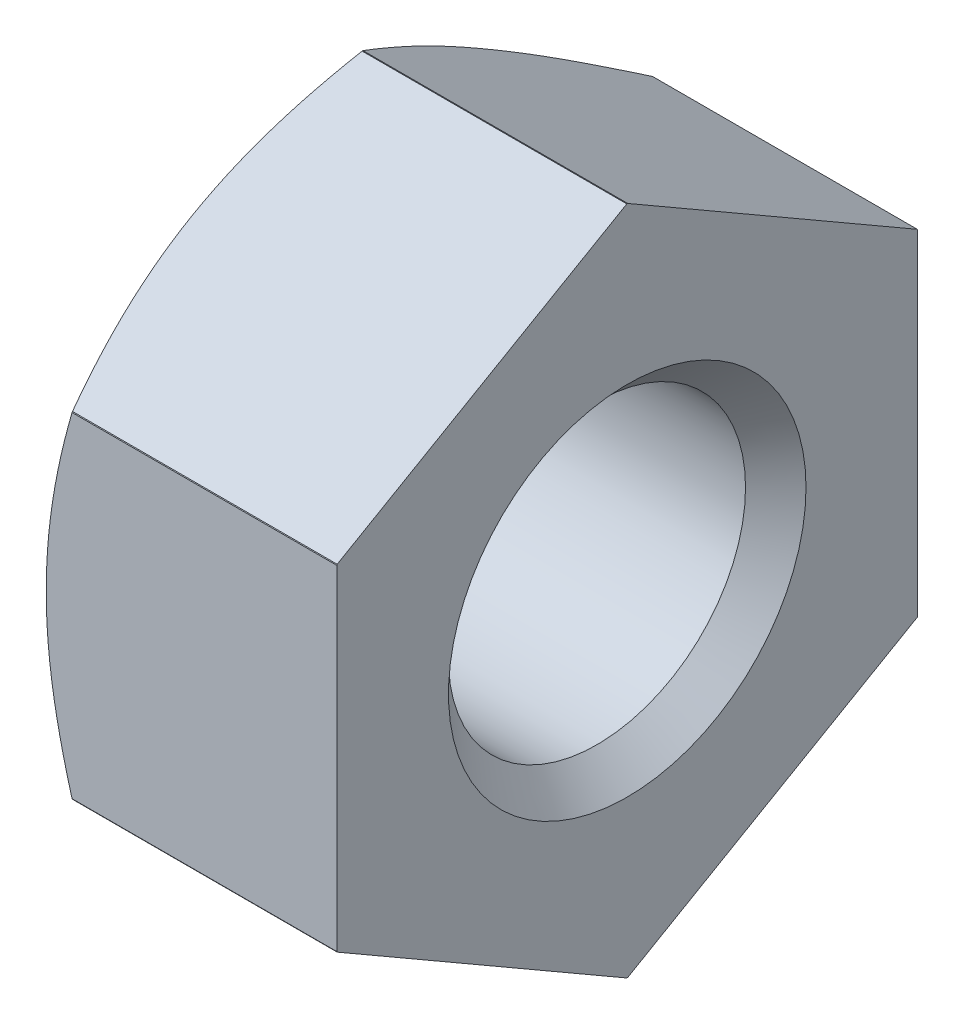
ISO-10303-21;
HEADER;
FILE_DESCRIPTION(('STEP AP214'),'2;1');
FILE_NAME('part.step','',(''),(''),'','','');
FILE_SCHEMA(('AUTOMOTIVE_DESIGN { 1 0 10303 214 1 1 1 1 }'));
ENDSEC;
DATA;
#1=APPLICATION_CONTEXT('core data for automotive mechanical design processes');
#2=APPLICATION_PROTOCOL_DEFINITION('international standard','automotive_design',2000,#1);
#3=PRODUCT_CONTEXT('',#1,'mechanical');
#4=PRODUCT('Part','Part','',(#3));
#5=PRODUCT_RELATED_PRODUCT_CATEGORY('part','',(#4));
#6=PRODUCT_DEFINITION_FORMATION('','',#4);
#7=PRODUCT_DEFINITION_CONTEXT('part definition',#1,'design');
#8=PRODUCT_DEFINITION('design','',#6,#7);
#9=PRODUCT_DEFINITION_SHAPE('','',#8);
#10=(LENGTH_UNIT() NAMED_UNIT(*) SI_UNIT(.MILLI.,.METRE.));
#11=(NAMED_UNIT(*) PLANE_ANGLE_UNIT() SI_UNIT($,.RADIAN.));
#12=(NAMED_UNIT(*) SI_UNIT($,.STERADIAN.) SOLID_ANGLE_UNIT());
#13=UNCERTAINTY_MEASURE_WITH_UNIT(LENGTH_MEASURE(1.E-05),#10,'distance_accuracy_value','');
#14=(GEOMETRIC_REPRESENTATION_CONTEXT(3) GLOBAL_UNCERTAINTY_ASSIGNED_CONTEXT((#13)) GLOBAL_UNIT_ASSIGNED_CONTEXT((#10,
#11,#12)) REPRESENTATION_CONTEXT('',''));
#15=CARTESIAN_POINT('',(0.,0.,0.));
#16=DIRECTION('',(0.,0.,1.));
#17=DIRECTION('',(1.,0.,0.));
#18=AXIS2_PLACEMENT_3D('',#15,#16,#17);
#19=CARTESIAN_POINT('',(-3.25,0.,0.));
#20=DIRECTION('',(1.,0.,0.));
#21=DIRECTION('',(0.,0.,-1.));
#22=AXIS2_PLACEMENT_3D('',#19,#20,#21);
#23=CONICAL_SURFACE('',#22,6.5,1.04719755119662);
#24=CARTESIAN_POINT('',(-2.6726497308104,0.,0.));
#25=DIRECTION('',(1.,0.,0.));
#26=DIRECTION('',(0.,-0.498887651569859,0.866666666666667));
#27=AXIS2_PLACEMENT_3D('',#24,#25,#26);
#28=CIRCLE('',#27,7.5);
#29=CARTESIAN_POINT('',(-2.6726497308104,-3.74165738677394,6.5));
#30=VERTEX_POINT('',#29);
#31=CARTESIAN_POINT('',(-2.6726497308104,-3.75833643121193,6.4903703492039));
#32=VERTEX_POINT('',#31);
#33=EDGE_CURVE('E142',#30,#32,#28,.T.);
#34=ORIENTED_EDGE('',*,*,#33,.F.);
#35=CARTESIAN_POINT('',(-2.67264975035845,-3.74165731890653,6.5));
#36=CARTESIAN_POINT('',(-2.69637145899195,-3.65930214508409,6.49999419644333));
#37=CARTESIAN_POINT('',(-2.71965488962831,-3.57681874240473,6.49977129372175));
#38=CARTESIAN_POINT('',(-2.76424155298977,-3.41487129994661,6.49915922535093));
#39=CARTESIAN_POINT('',(-2.78558675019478,-3.3354187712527,6.49877708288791));
#40=CARTESIAN_POINT('',(-2.82645297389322,-3.17878061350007,6.49808532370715));
#41=CARTESIAN_POINT('',(-2.8460106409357,-3.10160458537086,6.49777376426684));
#42=CARTESIAN_POINT('',(-2.8834619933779,-2.94878843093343,6.49735188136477));
#43=CARTESIAN_POINT('',(-2.90138414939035,-2.87315530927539,6.49723695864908));
#44=CARTESIAN_POINT('',(-2.93572539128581,-2.72271371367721,6.49724960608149));
#45=CARTESIAN_POINT('',(-2.95216265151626,-2.64790939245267,6.49737364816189));
#46=CARTESIAN_POINT('',(-2.98370308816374,-2.49843667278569,6.49780637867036));
#47=CARTESIAN_POINT('',(-2.9988129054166,-2.42376967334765,6.49811407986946));
#48=CARTESIAN_POINT('',(-3.02784516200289,-2.2739018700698,6.49881629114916));
#49=CARTESIAN_POINT('',(-3.04176270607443,-2.19870012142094,6.49921113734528));
#50=CARTESIAN_POINT('',(-3.06864262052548,-2.04713246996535,6.49975038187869));
#51=CARTESIAN_POINT('',(-3.0815904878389,-1.97076398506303,6.4998915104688));
#52=CARTESIAN_POINT('',(-3.10637237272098,-1.81660010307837,6.50011021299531));
#53=CARTESIAN_POINT('',(-3.11818542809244,-1.73880131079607,6.50018674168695));
#54=CARTESIAN_POINT('',(-3.14037231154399,-1.58218234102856,6.50054008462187));
#55=CARTESIAN_POINT('',(-3.15073008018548,-1.50335989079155,6.50081895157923));
#56=CARTESIAN_POINT('',(-3.17001806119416,-1.34507037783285,6.50130185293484));
#57=CARTESIAN_POINT('',(-3.17893951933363,-1.26560225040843,6.50150543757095));
#58=CARTESIAN_POINT('',(-3.19527831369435,-1.10636819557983,6.50178677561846));
#59=CARTESIAN_POINT('',(-3.20269294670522,-1.0266019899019,6.50186430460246));
#60=CARTESIAN_POINT('',(-3.21596623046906,-0.867105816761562,6.50185697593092));
#61=CARTESIAN_POINT('',(-3.22182806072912,-0.787376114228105,6.50177245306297));
#62=CARTESIAN_POINT('',(-3.23193693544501,-0.628269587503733,6.50147622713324));
#63=CARTESIAN_POINT('',(-3.2361929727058,-0.54889333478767,6.50126525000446));
#64=CARTESIAN_POINT('',(-3.24303529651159,-0.39079391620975,6.50080008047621));
#65=CARTESIAN_POINT('',(-3.24563646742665,-0.312071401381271,6.50054630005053));
#66=CARTESIAN_POINT('',(-3.24910571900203,-0.15556610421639,6.50015274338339));
#67=CARTESIAN_POINT('',(-3.24999491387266,-0.0777837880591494,6.50001159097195));
#68=CARTESIAN_POINT('',(-3.24999999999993,1.26739890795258E-06,6.5));
#69=B_SPLINE_CURVE_WITH_KNOTS('',3,(#35,#36,#37,#38,#39,#40,#41,#42,#43,#44,#45,#46,#47,#48,#49,
#50,#51,#52,#53,#54,#55,#56,#57,#58,#59,#60,#61,#62,#63,#64,#65,#66,#67,#68),.UNSPECIFIED.,.F.,
.F.,(4,2,2,2,2,2,2,2,2,2,2,2,2,2,2,2,4),(0.,0.257112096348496,0.503917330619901,
0.742756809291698,0.975929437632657,1.20568588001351,1.43421828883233,1.66364804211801,
1.8960139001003,2.13207112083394,2.37055722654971,2.61044595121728,2.85076130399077,
3.09058071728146,3.3290364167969,3.56531586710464,3.79866207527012),.UNSPECIFIED.);
#70=CARTESIAN_POINT('',(-3.25,0.,6.5));
#71=VERTEX_POINT('',#70);
#72=EDGE_CURVE('E126',#30,#71,#69,.T.);
#73=ORIENTED_EDGE('',*,*,#72,.T.);
#74=CARTESIAN_POINT('',(-3.25,0.,0.));
#75=DIRECTION('',(1.,0.,0.));
#76=DIRECTION('',(0.,0.,1.));
#77=AXIS2_PLACEMENT_3D('',#74,#75,#76);
#78=CIRCLE('',#77,6.5);
#79=CARTESIAN_POINT('',(-3.25,-5.62916512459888,3.24999999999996));
#80=VERTEX_POINT('',#79);
#81=EDGE_CURVE('E141',#71,#80,#78,.T.);
#82=ORIENTED_EDGE('',*,*,#81,.T.);
#83=CARTESIAN_POINT('',(-3.25,-5.62916522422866,3.24999982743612));
#84=CARTESIAN_POINT('',(-3.24998189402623,-5.6025822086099,3.29610700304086));
#85=CARTESIAN_POINT('',(-3.24960898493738,-5.57596391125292,3.34219448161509));
#86=CARTESIAN_POINT('',(-3.24812208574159,-5.52306387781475,3.43377596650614));
#87=CARTESIAN_POINT('',(-3.24701750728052,-5.49678213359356,3.47927012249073));
#88=CARTESIAN_POINT('',(-3.24404469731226,-5.44441875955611,3.57004625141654));
#89=CARTESIAN_POINT('',(-3.24218030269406,-5.41833678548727,3.6153281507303));
#90=CARTESIAN_POINT('',(-3.23770345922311,-5.36610078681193,3.70608027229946));
#91=CARTESIAN_POINT('',(-3.23508774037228,-5.33994695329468,3.75155044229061));
#92=CARTESIAN_POINT('',(-3.2291240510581,-5.28756550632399,3.8426238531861));
#93=CARTESIAN_POINT('',(-3.22577341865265,-5.26133797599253,3.88822696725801));
#94=CARTESIAN_POINT('',(-3.2183555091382,-5.2088154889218,3.97951165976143));
#95=CARTESIAN_POINT('',(-3.21428619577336,-5.18252055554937,4.02519308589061));
#96=CARTESIAN_POINT('',(-3.20544654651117,-5.12987753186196,4.11658039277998));
#97=CARTESIAN_POINT('',(-3.20067481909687,-5.1035294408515,4.16228613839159));
#98=CARTESIAN_POINT('',(-3.19044598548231,-5.05080260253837,4.25366874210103));
#99=CARTESIAN_POINT('',(-3.18498815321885,-5.0244238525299,4.29934551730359));
#100=CARTESIAN_POINT('',(-3.17340252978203,-4.97166711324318,4.39061782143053));
#101=CARTESIAN_POINT('',(-3.16727470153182,-4.9452891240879,4.43621334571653));
#102=CARTESIAN_POINT('',(-3.15436524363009,-4.89257284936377,4.52727115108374));
#103=CARTESIAN_POINT('',(-3.14758429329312,-4.86623455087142,4.57273352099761));
#104=CARTESIAN_POINT('',(-3.13338186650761,-4.81365053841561,4.66347638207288));
#105=CARTESIAN_POINT('',(-3.12596182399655,-4.78740474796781,4.70875705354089));
#106=CARTESIAN_POINT('',(-3.11050505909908,-4.73504976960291,4.79908079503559));
#107=CARTESIAN_POINT('',(-3.10247053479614,-4.70894042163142,4.84412414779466));
#108=CARTESIAN_POINT('',(-3.08576975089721,-4.65698086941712,4.93394703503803));
#109=CARTESIAN_POINT('',(-3.07710671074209,-4.63113002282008,4.9787267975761));
#110=CARTESIAN_POINT('',(-3.05931748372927,-4.57964370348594,5.0677270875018));
#111=CARTESIAN_POINT('',(-3.05019654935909,-4.55400854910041,5.11194885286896));
#112=CARTESIAN_POINT('',(-3.03152360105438,-4.50293598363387,5.19984831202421));
#113=CARTESIAN_POINT('',(-3.02197638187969,-4.47749894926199,5.24352724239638));
#114=CARTESIAN_POINT('',(-3.00239342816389,-4.426807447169,5.33055460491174));
#115=CARTESIAN_POINT('',(-2.9923606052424,-4.40155273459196,5.37390354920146));
#116=CARTESIAN_POINT('',(-2.97176586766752,-4.35116402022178,5.46046746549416));
#117=CARTESIAN_POINT('',(-2.96120465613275,-4.32602990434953,5.50368253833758));
#118=CARTESIAN_POINT('',(-2.93950834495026,-4.27581041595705,5.5901743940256));
#119=CARTESIAN_POINT('',(-2.92837165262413,-4.25072540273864,5.63345098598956));
#120=CARTESIAN_POINT('',(-2.90548080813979,-4.20051286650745,5.72025613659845));
#121=CARTESIAN_POINT('',(-2.89372277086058,-4.17538634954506,5.76378425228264));
#122=CARTESIAN_POINT('',(-2.86954530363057,-4.12498300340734,5.85127820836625));
#123=CARTESIAN_POINT('',(-2.85711980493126,-4.09970778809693,5.89524330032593));
#124=CARTESIAN_POINT('',(-2.83156340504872,-4.04888210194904,5.98379191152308));
#125=CARTESIAN_POINT('',(-2.81842446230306,-4.02333358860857,6.02837423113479));
#126=CARTESIAN_POINT('',(-2.79139689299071,-3.97181915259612,6.11833265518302));
#127=CARTESIAN_POINT('',(-2.77749854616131,-3.94585505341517,6.16370688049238));
#128=CARTESIAN_POINT('',(-2.74890753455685,-3.89335024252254,6.25541887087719));
#129=CARTESIAN_POINT('',(-2.73420382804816,-3.86681056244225,6.30175377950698));
#130=CARTESIAN_POINT('',(-2.7039571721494,-3.81297588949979,6.39555003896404));
#131=CARTESIAN_POINT('',(-2.68840226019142,-3.78568027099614,6.44300717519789));
#132=CARTESIAN_POINT('',(-2.6726497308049,-3.75833643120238,6.49037034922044));
#133=B_SPLINE_CURVE_WITH_KNOTS('',3,(#83,#84,#85,#86,#87,#88,#89,#90,#91,#92,#93,#94,#95,#96,
#97,#98,#99,#100,#101,#102,#103,#104,#105,#106,#107,#108,#109,#110,#111,#112,#113,#114,#115,
#116,#117,#118,#119,#120,#121,#122,#123,#124,#125,#126,#127,#128,#129,#130,#131,#132),
.UNSPECIFIED.,.F.,.F.,(4,2,2,2,2,2,2,2,2,2,2,2,2,2,2,2,2,2,2,2,2,2,2,2,4),(0.,0.159664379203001,
0.317313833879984,0.474176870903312,0.631733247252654,0.789870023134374,0.94846225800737,
1.10737300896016,1.26645336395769,1.42554252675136,1.58446797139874,1.74304568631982,
1.90108053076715,2.05835636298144,2.21412037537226,2.36843659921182,2.52192075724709,
2.67520584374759,2.82894061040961,2.98378790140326,3.14042296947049,3.29953192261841,
3.46181045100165,3.62796296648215,3.79870225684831),.UNSPECIFIED.);
#134=EDGE_CURVE('E155',#80,#32,#133,.T.);
#135=ORIENTED_EDGE('',*,*,#134,.T.);
#136=EDGE_LOOP('',(#34,#73,#82,#135));
#137=FACE_BOUND('',#136,.T.);
#138=ADVANCED_FACE('F17',(#137),#23,.T.);
#139=CARTESIAN_POINT('',(3.25,0.,0.));
#140=DIRECTION('',(1.,0.,0.));
#141=DIRECTION('',(0.,0.,-1.));
#142=AXIS2_PLACEMENT_3D('',#139,#140,#141);
#143=CYLINDRICAL_SURFACE('',#142,7.5);
#144=CARTESIAN_POINT('',(3.25,0.,0.));
#145=DIRECTION('',(1.,0.,0.));
#146=DIRECTION('',(0.,-0.498887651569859,0.866666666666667));
#147=AXIS2_PLACEMENT_3D('',#144,#145,#146);
#148=CIRCLE('',#147,7.5);
#149=CARTESIAN_POINT('',(3.25,-3.74165738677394,6.5));
#150=VERTEX_POINT('',#149);
#151=CARTESIAN_POINT('',(3.25,-3.75833643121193,6.49037034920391));
#152=VERTEX_POINT('',#151);
#153=EDGE_CURVE('E150',#150,#152,#148,.T.);
#154=ORIENTED_EDGE('',*,*,#153,.F.);
#155=DIRECTION('',(-1.,0.,0.));
#156=VECTOR('',#155,1.);
#157=CARTESIAN_POINT('',(3.25,-3.74165738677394,6.5));
#158=LINE('',#157,#156);
#159=EDGE_CURVE('E131',#150,#30,#158,.T.);
#160=ORIENTED_EDGE('',*,*,#159,.T.);
#161=ORIENTED_EDGE('',*,*,#33,.T.);
#162=DIRECTION('',(1.,0.,0.));
#163=VECTOR('',#162,1.);
#164=CARTESIAN_POINT('',(-2.6726497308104,-3.75833643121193,6.4903703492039));
#165=LINE('',#164,#163);
#166=EDGE_CURVE('E151',#32,#152,#165,.T.);
#167=ORIENTED_EDGE('',*,*,#166,.T.);
#168=EDGE_LOOP('',(#154,#160,#161,#167));
#169=FACE_BOUND('',#168,.T.);
#170=ADVANCED_FACE('F148',(#169),#143,.T.);
#171=CARTESIAN_POINT('',(3.25,3.7527767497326,6.5));
#172=DIRECTION('',(0.,0.,-1.));
#173=DIRECTION('',(-1.,0.,0.));
#174=AXIS2_PLACEMENT_3D('',#171,#172,#173);
#175=PLANE('',#174);
#176=CARTESIAN_POINT('',(-3.24999999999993,1.26739890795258E-06,6.5));
#177=CARTESIAN_POINT('',(-3.25000044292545,0.0228615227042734,6.49999924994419));
#178=CARTESIAN_POINT('',(-3.2499310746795,0.0457217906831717,6.49999877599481));
#179=CARTESIAN_POINT('',(-3.24965347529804,0.0910598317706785,6.50000124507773));
#180=CARTESIAN_POINT('',(-3.24944758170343,0.113537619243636,6.50000413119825));
#181=CARTESIAN_POINT('',(-3.2488976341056,0.158502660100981,6.50001597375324));
#182=CARTESIAN_POINT('',(-3.24855351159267,0.180989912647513,6.50002493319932));
#183=CARTESIAN_POINT('',(-3.24772838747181,0.225973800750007,6.5000466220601));
#184=CARTESIAN_POINT('',(-3.24724731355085,0.248470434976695,6.50005935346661));
#185=CARTESIAN_POINT('',(-3.2461487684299,0.293472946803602,6.50008774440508));
#186=CARTESIAN_POINT('',(-3.24553122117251,0.315978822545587,6.50010340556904));
#187=CARTESIAN_POINT('',(-3.24416042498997,0.360999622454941,6.50013652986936));
#188=CARTESIAN_POINT('',(-3.24340709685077,0.383514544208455,6.50015399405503));
#189=CARTESIAN_POINT('',(-3.24176537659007,0.428553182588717,6.50018978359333));
#190=CARTESIAN_POINT('',(-3.2408769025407,0.451076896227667,6.50020810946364));
#191=CARTESIAN_POINT('',(-3.2389655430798,0.49613280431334,6.50024474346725));
#192=CARTESIAN_POINT('',(-3.2379425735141,0.518664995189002,6.50026305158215));
#193=CARTESIAN_POINT('',(-3.23576287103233,0.563737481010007,6.50029886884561));
#194=CARTESIAN_POINT('',(-3.23460605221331,0.586277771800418,6.5003163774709));
#195=CARTESIAN_POINT('',(-3.23215929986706,0.631366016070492,6.50034990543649));
#196=CARTESIAN_POINT('',(-3.23086927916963,0.65391396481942,6.50036592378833));
#197=CARTESIAN_POINT('',(-3.22815677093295,0.699017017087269,6.50039587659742));
#198=CARTESIAN_POINT('',(-3.22673419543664,0.721572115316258,6.50040980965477));
#199=CARTESIAN_POINT('',(-3.22375722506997,0.766688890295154,6.50043509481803));
#200=CARTESIAN_POINT('',(-3.22220274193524,0.789250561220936,6.50044644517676));
#201=CARTESIAN_POINT('',(-3.21896260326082,0.834379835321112,6.50046616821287));
#202=CARTESIAN_POINT('',(-3.21727685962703,0.856947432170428,6.50047453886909));
#203=CARTESIAN_POINT('',(-3.21377484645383,0.90208784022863,6.50048800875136));
#204=CARTESIAN_POINT('',(-3.21195848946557,0.92466064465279,6.50049310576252));
#205=CARTESIAN_POINT('',(-3.20819589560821,0.969810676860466,6.50049984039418));
#206=CARTESIAN_POINT('',(-3.20624957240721,0.992387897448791,6.50050147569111));
#207=CARTESIAN_POINT('',(-3.20222769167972,1.03754589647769,6.50050120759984));
#208=CARTESIAN_POINT('',(-3.20015204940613,1.06012666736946,6.500499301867));
#209=CARTESIAN_POINT('',(-3.19587217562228,1.10529082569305,6.50049198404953));
#210=CARTESIAN_POINT('',(-3.19366786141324,1.12787420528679,6.50048656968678));
#211=CARTESIAN_POINT('',(-3.18913128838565,1.17304256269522,6.50047238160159));
#212=CARTESIAN_POINT('',(-3.18679894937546,1.19562753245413,6.50046360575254));
#213=CARTESIAN_POINT('',(-3.18200697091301,1.24079797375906,6.50044295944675));
#214=CARTESIAN_POINT('',(-3.17954725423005,1.2633834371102,6.50043108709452));
#215=CARTESIAN_POINT('',(-3.17450116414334,1.30855369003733,6.50040463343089));
#216=CARTESIAN_POINT('',(-3.17191471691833,1.33113847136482,6.50039005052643));
#217=CARTESIAN_POINT('',(-3.16661580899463,1.37630610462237,6.5003586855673));
#218=CARTESIAN_POINT('',(-3.16390327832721,1.39888894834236,6.50034190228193));
#219=CARTESIAN_POINT('',(-3.15835284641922,1.44405136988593,6.5003067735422));
#220=CARTESIAN_POINT('',(-3.15551487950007,1.46663093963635,6.50028842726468));
#221=CARTESIAN_POINT('',(-3.14971421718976,1.51178539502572,6.50025094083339));
#222=CARTESIAN_POINT('',(-3.14675146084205,1.53436027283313,6.50023180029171));
#223=CARTESIAN_POINT('',(-3.14070186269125,1.57950384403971,6.50019362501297));
#224=CARTESIAN_POINT('',(-3.13761496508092,1.60207252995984,6.50017459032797));
#225=CARTESIAN_POINT('',(-3.1313177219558,1.64720213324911,6.50013767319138));
#226=CARTESIAN_POINT('',(-3.12810732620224,1.66976304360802,6.5001197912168));
#227=CARTESIAN_POINT('',(-3.12156374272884,1.7148754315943,6.50008633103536));
#228=CARTESIAN_POINT('',(-3.1182305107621,1.73742690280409,6.500070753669));
#229=CARTESIAN_POINT('',(-3.1114418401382,1.78251865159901,6.50004333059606));
#230=CARTESIAN_POINT('',(-3.10798636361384,1.80505892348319,6.50003148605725));
#231=CARTESIAN_POINT('',(-3.10095405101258,1.85012647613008,6.50001260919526));
#232=CARTESIAN_POINT('',(-3.09737718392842,1.87265375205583,6.50000557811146));
#233=CARTESIAN_POINT('',(-3.09010458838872,1.9176769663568,6.49999940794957));
#234=CARTESIAN_POINT('',(-3.08640892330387,1.94017291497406,6.50000026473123));
#235=CARTESIAN_POINT('',(-3.07892373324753,1.98505112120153,6.49999223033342));
#236=CARTESIAN_POINT('',(-3.07513467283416,2.00743345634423,6.49998338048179));
#237=CARTESIAN_POINT('',(-3.06746165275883,2.05208631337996,6.49996222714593));
#238=CARTESIAN_POINT('',(-3.06357815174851,2.07435691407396,6.49994993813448));
#239=CARTESIAN_POINT('',(-3.05571476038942,2.11880280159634,6.4999242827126));
#240=CARTESIAN_POINT('',(-3.05173524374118,2.14097815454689,6.49991092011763));
#241=CARTESIAN_POINT('',(-3.04367785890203,2.18525006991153,6.49988571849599));
#242=CARTESIAN_POINT('',(-3.03960028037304,2.20734668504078,6.49987387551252));
#243=CARTESIAN_POINT('',(-3.03134493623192,2.25147775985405,6.49985344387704));
#244=CARTESIAN_POINT('',(-3.02716737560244,2.27351225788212,6.49984484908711));
#245=CARTESIAN_POINT('',(-3.01871019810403,2.31753581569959,6.49983207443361));
#246=CARTESIAN_POINT('',(-3.01443070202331,2.33952489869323,6.49982788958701));
#247=CARTESIAN_POINT('',(-3.00576779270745,2.38347442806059,6.49982445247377));
#248=CARTESIAN_POINT('',(-3.00138441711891,2.40543488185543,6.49982519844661));
#249=CARTESIAN_POINT('',(-2.99251188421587,2.44934403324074,6.49983152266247));
#250=CARTESIAN_POINT('',(-2.98802268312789,2.47129272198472,6.49983710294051));
#251=CARTESIAN_POINT('',(-2.97893663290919,2.51519529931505,6.49985237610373));
#252=CARTESIAN_POINT('',(-2.9743396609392,2.53714916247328,6.49986207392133));
#253=CARTESIAN_POINT('',(-2.96503620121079,2.58107911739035,6.49988424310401));
#254=CARTESIAN_POINT('',(-2.96032951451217,2.60305516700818,6.49989671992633));
#255=CARTESIAN_POINT('',(-2.95080474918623,2.64704659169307,6.49992250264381));
#256=CARTESIAN_POINT('',(-2.94598639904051,2.66906190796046,6.49993581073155));
#257=CARTESIAN_POINT('',(-2.936236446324,2.71314903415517,6.49996065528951));
#258=CARTESIAN_POINT('',(-2.93130450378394,2.73522076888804,6.49997218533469));
#259=CARTESIAN_POINT('',(-2.92132542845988,2.77943794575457,6.49999040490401));
#260=CARTESIAN_POINT('',(-2.91627789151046,2.80158329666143,6.49999707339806));
#261=CARTESIAN_POINT('',(-2.90608484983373,2.84588294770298,6.50000131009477));
#262=CARTESIAN_POINT('',(-2.90093922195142,2.86803721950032,6.49999886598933));
#263=CARTESIAN_POINT('',(-2.89058548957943,2.91219329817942,6.49999120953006));
#264=CARTESIAN_POINT('',(-2.88537793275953,2.93419523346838,6.49998601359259));
#265=CARTESIAN_POINT('',(-2.87489229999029,2.97808482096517,6.4999767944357));
#266=CARTESIAN_POINT('',(-2.86961461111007,2.99997256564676,6.49997276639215));
#267=CARTESIAN_POINT('',(-2.85897874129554,3.04368081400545,6.49996806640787));
#268=CARTESIAN_POINT('',(-2.85362074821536,3.06550136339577,6.4999673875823));
#269=CARTESIAN_POINT('',(-2.84281432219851,3.10912278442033,6.4999696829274));
#270=CARTESIAN_POINT('',(-2.83736587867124,3.13092365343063,6.49997265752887));
#271=CARTESIAN_POINT('',(-2.82636856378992,3.17455376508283,6.49998080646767));
#272=CARTESIAN_POINT('',(-2.82081948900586,3.19638295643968,6.49998598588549));
#273=CARTESIAN_POINT('',(-2.8096110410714,3.24011827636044,6.49999501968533));
#274=CARTESIAN_POINT('',(-2.80395128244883,3.26202430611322,6.49999886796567));
#275=CARTESIAN_POINT('',(-2.79254328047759,3.30583868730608,6.50000083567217));
#276=CARTESIAN_POINT('',(-2.7867949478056,3.32774701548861,6.49999894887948));
#277=CARTESIAN_POINT('',(-2.77523816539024,3.37144937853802,6.49999632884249));
#278=CARTESIAN_POINT('',(-2.7694300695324,3.39324350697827,6.49999559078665));
#279=CARTESIAN_POINT('',(-2.7577302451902,3.43681220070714,6.49999640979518));
#280=CARTESIAN_POINT('',(-2.75183850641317,3.45858676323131,6.49999796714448));
#281=CARTESIAN_POINT('',(-2.73995554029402,3.50218638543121,6.49999961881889));
#282=CARTESIAN_POINT('',(-2.73396404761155,3.52401137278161,6.49999970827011));
#283=CARTESIAN_POINT('',(-2.72191151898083,3.56760258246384,6.49999989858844));
#284=CARTESIAN_POINT('',(-2.71585061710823,3.58936884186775,6.49999999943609));
#285=CARTESIAN_POINT('',(-2.70365191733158,3.63287587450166,6.49999979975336));
#286=CARTESIAN_POINT('',(-2.69751413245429,3.65461665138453,6.49999949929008));
#287=CARTESIAN_POINT('',(-2.68514678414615,3.69812851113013,6.49999927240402));
#288=CARTESIAN_POINT('',(-2.6789170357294,3.7198995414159,6.49999934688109));
#289=CARTESIAN_POINT('',(-2.67264910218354,3.74165956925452,6.50000000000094));
#290=B_SPLINE_CURVE_WITH_KNOTS('',3,(#176,#177,#178,#179,#180,#181,#182,#183,#184,#185,#186,
#187,#188,#189,#190,#191,#192,#193,#194,#195,#196,#197,#198,#199,#200,#201,#202,#203,#204,#205,
#206,#207,#208,#209,#210,#211,#212,#213,#214,#215,#216,#217,#218,#219,#220,#221,#222,#223,#224,
#225,#226,#227,#228,#229,#230,#231,#232,#233,#234,#235,#236,#237,#238,#239,#240,#241,#242,#243,
#244,#245,#246,#247,#248,#249,#250,#251,#252,#253,#254,#255,#256,#257,#258,#259,#260,#261,#262,
#263,#264,#265,#266,#267,#268,#269,#270,#271,#272,#273,#274,#275,#276,#277,#278,#279,#280,#281,
#282,#283,#284,#285,#286,#287,#288,#289),.UNSPECIFIED.,.F.,.F.,(4,2,2,2,2,2,2,2,2,2,2,2,2,2,2,2,
2,2,2,2,2,2,2,2,2,2,2,2,2,2,2,2,2,2,2,2,2,2,2,2,2,2,2,2,2,2,2,2,2,2,2,2,2,2,2,2,4),(0.,
0.068580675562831,0.136016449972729,0.203485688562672,0.270990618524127,0.338533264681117,
0.406115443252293,0.47373875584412,0.54140458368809,0.609114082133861,0.676868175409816,
0.744667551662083,0.812512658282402,0.88040369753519,0.948340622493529,1.01632313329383,
1.08435067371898,1.15242242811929,1.2205373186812,1.28869400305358,1.35689087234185,
1.4251260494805,1.4933973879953,1.56170247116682,1.63003861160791,1.69840285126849,
1.76679196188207,1.8352024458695,1.9036305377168,1.97202271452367,2.04012482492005,
2.10794454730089,2.17553308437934,2.24294189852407,2.3102226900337,2.37742737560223,
2.44460806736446,2.51181705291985,2.57910677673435,2.64652982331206,2.71413890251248,
2.78198683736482,2.85012655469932,2.91835833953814,2.98618759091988,3.05373253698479,
3.12113857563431,3.18855256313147,3.25612273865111,3.32399866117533,3.39194821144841,
3.45961237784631,3.52728494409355,3.59518216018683,3.66296505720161,3.73073662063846,
3.79867091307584),.UNSPECIFIED.);
#291=CARTESIAN_POINT('',(-2.6726497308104,3.74165738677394,6.5));
#292=VERTEX_POINT('',#291);
#293=EDGE_CURVE('E134',#71,#292,#290,.T.);
#294=ORIENTED_EDGE('',*,*,#293,.F.);
#295=ORIENTED_EDGE('',*,*,#72,.F.);
#296=ORIENTED_EDGE('',*,*,#159,.F.);
#297=DIRECTION('',(0.,-1.,0.));
#298=VECTOR('',#297,1.);
#299=CARTESIAN_POINT('',(3.25,3.74165738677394,6.5));
#300=LINE('',#299,#298);
#301=CARTESIAN_POINT('',(3.25,3.74165738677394,6.5));
#302=VERTEX_POINT('',#301);
#303=EDGE_CURVE('E365',#302,#150,#300,.T.);
#304=ORIENTED_EDGE('',*,*,#303,.F.);
#305=DIRECTION('',(1.,0.,0.));
#306=VECTOR('',#305,1.);
#307=CARTESIAN_POINT('',(-2.6726497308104,3.74165738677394,6.5));
#308=LINE('',#307,#306);
#309=EDGE_CURVE('E363',#292,#302,#308,.T.);
#310=ORIENTED_EDGE('',*,*,#309,.F.);
#311=EDGE_LOOP('',(#294,#295,#296,#304,#310));
#312=FACE_BOUND('',#311,.T.);
#313=ADVANCED_FACE('F129',(#312),#175,.F.);
#314=CARTESIAN_POINT('',(-3.25,0.,0.));
#315=DIRECTION('',(1.,0.,0.));
#316=DIRECTION('',(0.,0.,-1.));
#317=AXIS2_PLACEMENT_3D('',#314,#315,#316);
#318=PLANE('',#317);
#319=CARTESIAN_POINT('',(-3.25,0.,0.));
#320=DIRECTION('',(1.,0.,0.));
#321=DIRECTION('',(0.,0.,-1.));
#322=AXIS2_PLACEMENT_3D('',#319,#320,#321);
#323=CIRCLE('',#322,4.);
#324=CARTESIAN_POINT('',(-3.25,0.,-4.));
#325=VERTEX_POINT('',#324);
#326=EDGE_CURVE('E364',#325,#325,#323,.T.);
#327=ORIENTED_EDGE('',*,*,#326,.T.);
#328=EDGE_LOOP('',(#327));
#329=FACE_BOUND('',#328,.T.);
#330=CARTESIAN_POINT('',(-3.25,0.,0.));
#331=DIRECTION('',(1.,0.,0.));
#332=DIRECTION('',(0.,0.,-1.));
#333=AXIS2_PLACEMENT_3D('',#330,#331,#332);
#334=CIRCLE('',#333,6.5);
#335=CARTESIAN_POINT('',(-3.25,0.,-6.5));
#336=VERTEX_POINT('',#335);
#337=CARTESIAN_POINT('',(-3.25,5.62916512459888,-3.24999999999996));
#338=VERTEX_POINT('',#337);
#339=EDGE_CURVE('E368',#336,#338,#334,.T.);
#340=ORIENTED_EDGE('',*,*,#339,.F.);
#341=CARTESIAN_POINT('',(-3.25,0.,0.));
#342=DIRECTION('',(1.,0.,0.));
#343=DIRECTION('',(0.,-0.866025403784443,-0.499999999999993));
#344=AXIS2_PLACEMENT_3D('',#341,#342,#343);
#345=CIRCLE('',#344,6.5);
#346=CARTESIAN_POINT('',(-3.25,-5.62916512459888,-3.24999999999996));
#347=VERTEX_POINT('',#346);
#348=EDGE_CURVE('E377',#347,#336,#345,.T.);
#349=ORIENTED_EDGE('',*,*,#348,.F.);
#350=CARTESIAN_POINT('',(-3.25,0.,0.));
#351=DIRECTION('',(1.,0.,0.));
#352=DIRECTION('',(0.,-0.866025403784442,0.499999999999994));
#353=AXIS2_PLACEMENT_3D('',#350,#351,#352);
#354=CIRCLE('',#353,6.5);
#355=EDGE_CURVE('E262',#80,#347,#354,.T.);
#356=ORIENTED_EDGE('',*,*,#355,.F.);
#357=ORIENTED_EDGE('',*,*,#81,.F.);
#358=CARTESIAN_POINT('',(-3.25,0.,0.));
#359=DIRECTION('',(1.,0.,0.));
#360=DIRECTION('',(0.,0.866025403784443,0.499999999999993));
#361=AXIS2_PLACEMENT_3D('',#358,#359,#360);
#362=CIRCLE('',#361,6.5);
#363=CARTESIAN_POINT('',(-3.25,5.62916512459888,3.24999999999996));
#364=VERTEX_POINT('',#363);
#365=EDGE_CURVE('E251',#364,#71,#362,.T.);
#366=ORIENTED_EDGE('',*,*,#365,.F.);
#367=CARTESIAN_POINT('',(-3.25,0.,0.));
#368=DIRECTION('',(1.,0.,0.));
#369=DIRECTION('',(0.,0.866025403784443,-0.499999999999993));
#370=AXIS2_PLACEMENT_3D('',#367,#368,#369);
#371=CIRCLE('',#370,6.5);
#372=EDGE_CURVE('E259',#338,#364,#371,.T.);
#373=ORIENTED_EDGE('',*,*,#372,.F.);
#374=EDGE_LOOP('',(#340,#349,#356,#357,#366,#373));
#375=FACE_BOUND('',#374,.T.);
#376=ADVANCED_FACE('F258',(#329,#375),#318,.F.);
#377=CARTESIAN_POINT('',(3.25,-3.7527767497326,6.5));
#378=DIRECTION('',(0.,0.866025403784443,-0.499999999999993));
#379=DIRECTION('',(0.,0.499999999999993,0.866025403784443));
#380=AXIS2_PLACEMENT_3D('',#377,#378,#379);
#381=PLANE('',#380);
#382=ORIENTED_EDGE('',*,*,#134,.F.);
#383=CARTESIAN_POINT('',(-2.67264973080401,-7.49999381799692,0.00962965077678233));
#384=CARTESIAN_POINT('',(-2.6964379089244,-7.45869588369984,0.0811482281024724));
#385=CARTESIAN_POINT('',(-2.71978217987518,-7.41714972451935,0.152673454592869));
#386=CARTESIAN_POINT('',(-2.76448652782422,-7.33541703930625,0.293044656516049));
#387=CARTESIAN_POINT('',(-2.78588859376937,-7.29524215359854,0.361884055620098));
#388=CARTESIAN_POINT('',(-2.82686200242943,-7.21608622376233,0.497636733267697));
#389=CARTESIAN_POINT('',(-2.84647009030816,-7.17710835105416,0.564540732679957));
#390=CARTESIAN_POINT('',(-2.88401307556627,-7.10009805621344,0.697103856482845));
#391=CARTESIAN_POINT('',(-2.90197672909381,-7.06206526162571,0.762754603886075));
#392=CARTESIAN_POINT('',(-2.93638905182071,-6.98663250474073,0.893433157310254));
#393=CARTESIAN_POINT('',(-2.95285643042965,-6.94923162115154,0.95845549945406));
#394=CARTESIAN_POINT('',(-2.98444226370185,-6.87467735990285,1.0884317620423));
#395=CARTESIAN_POINT('',(-2.99956816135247,-6.83752383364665,1.15338378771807));
#396=CARTESIAN_POINT('',(-3.02861547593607,-6.76305432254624,1.2837382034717));
#397=CARTESIAN_POINT('',(-3.04253304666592,-6.72573818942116,1.34914136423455));
#398=CARTESIAN_POINT('',(-3.06939114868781,-6.65035124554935,1.48076729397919));
#399=CARTESIAN_POINT('',(-3.08231828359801,-6.61227671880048,1.54699066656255));
#400=CARTESIAN_POINT('',(-3.10704399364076,-6.53539976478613,1.68056877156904));
#401=CARTESIAN_POINT('',(-3.11882303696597,-6.49659490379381,1.74792574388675));
#402=CARTESIAN_POINT('',(-3.14093783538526,-6.41867538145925,1.88356212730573));
#403=CARTESIAN_POINT('',(-3.15125890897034,-6.37956125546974,1.95184424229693));
#404=CARTESIAN_POINT('',(-3.17047027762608,-6.30097321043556,2.0888876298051));
#405=CARTESIAN_POINT('',(-3.17935274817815,-6.26149848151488,2.1576495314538));
#406=CARTESIAN_POINT('',(-3.19561400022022,-6.18231221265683,2.29534248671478));
#407=CARTESIAN_POINT('',(-3.20299069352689,-6.14260042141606,2.36427364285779));
#408=CARTESIAN_POINT('',(-3.21619133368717,-6.06306857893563,2.50201248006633));
#409=CARTESIAN_POINT('',(-3.22201876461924,-6.02324897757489,2.57082008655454));
#410=CARTESIAN_POINT('',(-3.23206513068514,-5.94368129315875,2.70806801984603));
#411=CARTESIAN_POINT('',(-3.23629305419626,-5.90393409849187,2.77650820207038));
#412=CARTESIAN_POINT('',(-3.24308831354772,-5.82472354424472,2.91281436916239));
#413=CARTESIAN_POINT('',(-3.24567020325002,-5.78526083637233,2.98067999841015));
#414=CARTESIAN_POINT('',(-3.24911344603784,-5.70688570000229,3.11567628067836));
#415=CARTESIAN_POINT('',(-3.24999521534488,-5.66797238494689,3.18280590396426));
#416=CARTESIAN_POINT('',(-3.25,-5.62916522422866,3.24999982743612));
#417=B_SPLINE_CURVE_WITH_KNOTS('',3,(#383,#384,#385,#386,#387,#388,#389,#390,#391,#392,#393,
#394,#395,#396,#397,#398,#399,#400,#401,#402,#403,#404,#405,#406,#407,#408,#409,#410,#411,#412,
#413,#414,#415,#416),.UNSPECIFIED.,.F.,.F.,(4,2,2,2,2,2,2,2,2,2,2,2,2,2,2,2,4),(0.,
0.257832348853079,0.505410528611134,0.74502412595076,0.978921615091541,1.20930429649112,
1.4383162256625,1.66803226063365,1.9004465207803,2.13630013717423,2.3743812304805,
2.61371665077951,2.85338175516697,3.09250323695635,3.33026028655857,3.56588486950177,
3.79866184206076),.UNSPECIFIED.);
#418=CARTESIAN_POINT('',(-2.6726497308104,-7.49999381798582,0.00962965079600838));
#419=VERTEX_POINT('',#418);
#420=EDGE_CURVE('E269',#419,#80,#417,.T.);
#421=ORIENTED_EDGE('',*,*,#420,.F.);
#422=DIRECTION('',(-1.,0.,0.));
#423=VECTOR('',#422,1.);
#424=CARTESIAN_POINT('',(3.25,-7.49999381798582,0.00962965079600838));
#425=LINE('',#424,#423);
#426=CARTESIAN_POINT('',(3.25,-7.49999381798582,0.00962965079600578));
#427=VERTEX_POINT('',#426);
#428=EDGE_CURVE('E271',#427,#419,#425,.T.);
#429=ORIENTED_EDGE('',*,*,#428,.F.);
#430=DIRECTION('',(0.,-0.499999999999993,-0.866025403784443));
#431=VECTOR('',#430,1.);
#432=CARTESIAN_POINT('',(3.25,-3.75833643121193,6.49037034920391));
#433=LINE('',#432,#431);
#434=EDGE_CURVE('E307',#152,#427,#433,.T.);
#435=ORIENTED_EDGE('',*,*,#434,.F.);
#436=ORIENTED_EDGE('',*,*,#166,.F.);
#437=EDGE_LOOP('',(#382,#421,#429,#435,#436));
#438=FACE_BOUND('',#437,.T.);
#439=ADVANCED_FACE('F285',(#438),#381,.F.);
#440=CARTESIAN_POINT('',(3.25,7.5,0.));
#441=DIRECTION('',(-1.,0.,0.));
#442=DIRECTION('',(0.,0.,1.));
#443=AXIS2_PLACEMENT_3D('',#440,#441,#442);
#444=PLANE('',#443);
#445=CARTESIAN_POINT('',(3.25,0.,0.));
#446=DIRECTION('',(1.,0.,0.));
#447=DIRECTION('',(0.,0.,-1.));
#448=AXIS2_PLACEMENT_3D('',#445,#446,#447);
#449=CIRCLE('',#448,4.);
#450=CARTESIAN_POINT('',(3.25,0.,-4.));
#451=VERTEX_POINT('',#450);
#452=EDGE_CURVE('E312',#451,#451,#449,.T.);
#453=ORIENTED_EDGE('',*,*,#452,.F.);
#454=EDGE_LOOP('',(#453));
#455=FACE_BOUND('',#454,.T.);
#456=CARTESIAN_POINT('',(3.25,0.,0.));
#457=DIRECTION('',(1.,0.,0.));
#458=DIRECTION('',(0.,0.501111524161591,0.865382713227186));
#459=AXIS2_PLACEMENT_3D('',#456,#457,#458);
#460=CIRCLE('',#459,7.5);
#461=CARTESIAN_POINT('',(3.25,3.75833643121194,6.4903703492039));
#462=VERTEX_POINT('',#461);
#463=EDGE_CURVE('E317',#462,#302,#460,.T.);
#464=ORIENTED_EDGE('',*,*,#463,.T.);
#465=ORIENTED_EDGE('',*,*,#303,.T.);
#466=ORIENTED_EDGE('',*,*,#153,.T.);
#467=ORIENTED_EDGE('',*,*,#434,.T.);
#468=CARTESIAN_POINT('',(3.25,0.,0.));
#469=DIRECTION('',(1.,0.,0.));
#470=DIRECTION('',(0.,-0.999999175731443,0.00128395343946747));
#471=AXIS2_PLACEMENT_3D('',#468,#469,#470);
#472=CIRCLE('',#471,7.5);
#473=CARTESIAN_POINT('',(3.25,-7.49999381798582,-0.00962965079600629));
#474=VERTEX_POINT('',#473);
#475=EDGE_CURVE('E320',#427,#474,#472,.T.);
#476=ORIENTED_EDGE('',*,*,#475,.T.);
#477=DIRECTION('',(0.,0.499999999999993,-0.866025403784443));
#478=VECTOR('',#477,1.);
#479=CARTESIAN_POINT('',(3.25,-7.49999381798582,-0.00962965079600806));
#480=LINE('',#479,#478);
#481=CARTESIAN_POINT('',(3.25,-3.75833643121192,-6.4903703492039));
#482=VERTEX_POINT('',#481);
#483=EDGE_CURVE('E325',#474,#482,#480,.T.);
#484=ORIENTED_EDGE('',*,*,#483,.T.);
#485=CARTESIAN_POINT('',(3.25,0.,0.));
#486=DIRECTION('',(1.,0.,0.));
#487=DIRECTION('',(0.,-0.501111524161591,-0.865382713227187));
#488=AXIS2_PLACEMENT_3D('',#485,#486,#487);
#489=CIRCLE('',#488,7.5);
#490=CARTESIAN_POINT('',(3.25,-3.74165738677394,-6.5));
#491=VERTEX_POINT('',#490);
#492=EDGE_CURVE('E330',#482,#491,#489,.T.);
#493=ORIENTED_EDGE('',*,*,#492,.T.);
#494=DIRECTION('',(0.,1.,0.));
#495=VECTOR('',#494,1.);
#496=CARTESIAN_POINT('',(3.25,-3.74165738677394,-6.5));
#497=LINE('',#496,#495);
#498=CARTESIAN_POINT('',(3.25,3.74165738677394,-6.5));
#499=VERTEX_POINT('',#498);
#500=EDGE_CURVE('E335',#491,#499,#497,.T.);
#501=ORIENTED_EDGE('',*,*,#500,.T.);
#502=CARTESIAN_POINT('',(3.25,0.,0.));
#503=DIRECTION('',(1.,0.,0.));
#504=DIRECTION('',(0.,0.498887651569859,-0.866666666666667));
#505=AXIS2_PLACEMENT_3D('',#502,#503,#504);
#506=CIRCLE('',#505,7.5);
#507=CARTESIAN_POINT('',(3.25,3.75833643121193,-6.4903703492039));
#508=VERTEX_POINT('',#507);
#509=EDGE_CURVE('E340',#499,#508,#506,.T.);
#510=ORIENTED_EDGE('',*,*,#509,.T.);
#511=DIRECTION('',(0.,0.499999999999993,0.866025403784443));
#512=VECTOR('',#511,1.);
#513=CARTESIAN_POINT('',(3.25,3.75833643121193,-6.4903703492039));
#514=LINE('',#513,#512);
#515=CARTESIAN_POINT('',(3.25,7.49999381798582,-0.00962965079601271));
#516=VERTEX_POINT('',#515);
#517=EDGE_CURVE('E345',#508,#516,#514,.T.);
#518=ORIENTED_EDGE('',*,*,#517,.T.);
#519=CARTESIAN_POINT('',(3.25,0.,0.));
#520=DIRECTION('',(1.,0.,0.));
#521=DIRECTION('',(0.,0.999999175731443,-0.00128395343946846));
#522=AXIS2_PLACEMENT_3D('',#519,#520,#521);
#523=CIRCLE('',#522,7.5);
#524=CARTESIAN_POINT('',(3.25,7.49999381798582,0.0096296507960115));
#525=VERTEX_POINT('',#524);
#526=EDGE_CURVE('E350',#516,#525,#523,.T.);
#527=ORIENTED_EDGE('',*,*,#526,.T.);
#528=DIRECTION('',(0.,-0.499999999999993,0.866025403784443));
#529=VECTOR('',#528,1.);
#530=CARTESIAN_POINT('',(3.25,7.49999381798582,0.00962965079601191));
#531=LINE('',#530,#529);
#532=EDGE_CURVE('E245',#525,#462,#531,.T.);
#533=ORIENTED_EDGE('',*,*,#532,.T.);
#534=EDGE_LOOP('',(#464,#465,#466,#467,#476,#484,#493,#501,#510,#518,#527,#533));
#535=FACE_BOUND('',#534,.T.);
#536=ADVANCED_FACE('F295',(#455,#535),#444,.F.);
#537=ORIENTED_EDGE('',*,*,#365,.T.);
#538=ORIENTED_EDGE('',*,*,#293,.T.);
#539=CARTESIAN_POINT('',(-2.6726497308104,0.,0.));
#540=DIRECTION('',(1.,0.,0.));
#541=DIRECTION('',(0.,0.501111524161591,0.865382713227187));
#542=AXIS2_PLACEMENT_3D('',#539,#540,#541);
#543=CIRCLE('',#542,7.5);
#544=CARTESIAN_POINT('',(-2.6726497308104,3.75833643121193,6.4903703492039));
#545=VERTEX_POINT('',#544);
#546=EDGE_CURVE('E237',#545,#292,#543,.T.);
#547=ORIENTED_EDGE('',*,*,#546,.F.);
#548=CARTESIAN_POINT('',(-2.67264973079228,3.75833643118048,6.49037034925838));
#549=CARTESIAN_POINT('',(-2.6964378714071,3.79962430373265,6.41884611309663));
#550=CARTESIAN_POINT('',(-2.71978210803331,3.84079381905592,6.3471035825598));
#551=CARTESIAN_POINT('',(-2.76448638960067,3.92149235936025,6.20613563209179));
#552=CARTESIAN_POINT('',(-2.78588842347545,3.96102150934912,6.13692358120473));
#553=CARTESIAN_POINT('',(-2.82686177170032,4.03900866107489,6.00049643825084));
#554=CARTESIAN_POINT('',(-2.84646983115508,4.07746021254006,5.93328873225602));
#555=CARTESIAN_POINT('',(-2.8840127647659,4.15375795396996,5.8003145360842));
#556=CARTESIAN_POINT('',(-2.90197639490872,4.19159670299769,5.73455191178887));
#557=CARTESIAN_POINT('',(-2.93638867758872,4.2670511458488,5.60388616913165));
#558=CARTESIAN_POINT('',(-2.95285603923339,4.30466164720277,5.53898498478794));
#559=CARTESIAN_POINT('',(-2.98444184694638,4.37994716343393,5.40943115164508));
#560=CARTESIAN_POINT('',(-2.9995677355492,4.41762046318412,5.34477932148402));
#561=CARTESIAN_POINT('',(-3.02861504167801,4.49327587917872,5.21510975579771));
#562=CARTESIAN_POINT('',(-3.04253261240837,4.53125858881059,5.15009150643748));
#563=CARTESIAN_POINT('',(-3.06939072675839,4.60755648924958,5.01899159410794));
#564=CARTESIAN_POINT('',(-3.08231787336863,4.64587034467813,4.95290641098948));
#565=CARTESIAN_POINT('',(-3.10704361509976,4.72311391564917,4.81953994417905));
#566=CARTESIAN_POINT('',(-3.11882267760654,4.76204435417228,4.7522554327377));
#567=CARTESIAN_POINT('',(-3.14093751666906,4.84054920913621,4.61695686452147));
#568=CARTESIAN_POINT('',(-3.15125861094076,4.88012623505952,4.54894191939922));
#569=CARTESIAN_POINT('',(-3.17047002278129,4.9595153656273,4.41236083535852));
#570=CARTESIAN_POINT('',(-3.17935251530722,4.99932761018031,4.34379368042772));
#571=CARTESIAN_POINT('',(-3.19561381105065,5.07898019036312,4.20636969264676));
#572=CARTESIAN_POINT('',(-3.20299052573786,5.11882048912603,4.13751259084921));
#573=CARTESIAN_POINT('',(-3.21619120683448,5.19834002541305,3.9997663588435));
#574=CARTESIAN_POINT('',(-3.22201865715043,5.23801942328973,3.93087765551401));
#575=CARTESIAN_POINT('',(-3.23206505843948,5.31709590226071,3.79334582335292));
#576=CARTESIAN_POINT('',(-3.23629299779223,5.35649330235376,3.72470353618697));
#577=CARTESIAN_POINT('',(-3.24308828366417,5.43493274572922,3.58795187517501));
#578=CARTESIAN_POINT('',(-3.24567018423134,5.47397480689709,3.51984324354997));
#579=CARTESIAN_POINT('',(-3.24911344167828,5.55169755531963,3.38447003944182));
#580=CARTESIAN_POINT('',(-3.24999521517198,5.59037690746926,3.3172052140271));
#581=CARTESIAN_POINT('',(-3.25,5.62916502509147,3.25000017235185));
#582=B_SPLINE_CURVE_WITH_KNOTS('',3,(#548,#549,#550,#551,#552,#553,#554,#555,#556,#557,#558,
#559,#560,#561,#562,#563,#564,#565,#566,#567,#568,#569,#570,#571,#572,#573,#574,#575,#576,#577,
#578,#579,#580,#581),.UNSPECIFIED.,.F.,.F.,(4,2,2,2,2,2,2,2,2,2,2,2,2,2,2,2,4),(0.,
0.257831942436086,0.505409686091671,0.7450228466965,0.978919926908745,1.2093022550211,
1.43831391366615,1.66802978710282,1.90044401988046,2.13629775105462,2.3743790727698,
2.61371480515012,2.85338027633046,3.09250215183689,3.33025959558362,3.56588454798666,
3.7986618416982),.UNSPECIFIED.);
#583=EDGE_CURVE('E244',#545,#364,#582,.T.);
#584=ORIENTED_EDGE('',*,*,#583,.T.);
#585=EDGE_LOOP('',(#537,#538,#547,#584));
#586=FACE_BOUND('',#585,.T.);
#587=ADVANCED_FACE('F175',(#586),#23,.T.);
#588=ORIENTED_EDGE('',*,*,#546,.T.);
#589=ORIENTED_EDGE('',*,*,#309,.T.);
#590=ORIENTED_EDGE('',*,*,#463,.F.);
#591=DIRECTION('',(-1.,0.,0.));
#592=VECTOR('',#591,1.);
#593=CARTESIAN_POINT('',(3.25,3.75833643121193,6.4903703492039));
#594=LINE('',#593,#592);
#595=EDGE_CURVE('E253',#462,#545,#594,.T.);
#596=ORIENTED_EDGE('',*,*,#595,.T.);
#597=EDGE_LOOP('',(#588,#589,#590,#596));
#598=FACE_BOUND('',#597,.T.);
#599=ADVANCED_FACE('F362',(#598),#143,.T.);
#600=CARTESIAN_POINT('',(-3.25,0.,0.));
#601=DIRECTION('',(-1.,0.,0.));
#602=DIRECTION('',(0.,0.,1.));
#603=AXIS2_PLACEMENT_3D('',#600,#601,#602);
#604=CONICAL_SURFACE('',#603,4.,0.785398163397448);
#605=CARTESIAN_POINT('',(-2.5735,0.,0.));
#606=DIRECTION('',(1.,0.,0.));
#607=DIRECTION('',(0.,0.,-1.));
#608=AXIS2_PLACEMENT_3D('',#605,#606,#607);
#609=CIRCLE('',#608,3.3235);
#610=CARTESIAN_POINT('',(-2.5735,0.,-3.3235));
#611=VERTEX_POINT('',#610);
#612=EDGE_CURVE('E488',#611,#611,#609,.T.);
#613=ORIENTED_EDGE('',*,*,#612,.T.);
#614=EDGE_LOOP('',(#613));
#615=FACE_BOUND('',#614,.T.);
#616=ORIENTED_EDGE('',*,*,#326,.F.);
#617=EDGE_LOOP('',(#616));
#618=FACE_BOUND('',#617,.T.);
#619=ADVANCED_FACE('F436',(#615,#618),#604,.F.);
#620=ORIENTED_EDGE('',*,*,#339,.T.);
#621=CARTESIAN_POINT('',(-3.25,5.62916522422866,-3.24999982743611));
#622=CARTESIAN_POINT('',(-3.24998189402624,5.6025822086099,-3.29610700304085));
#623=CARTESIAN_POINT('',(-3.24960898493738,5.57596391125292,-3.34219448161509));
#624=CARTESIAN_POINT('',(-3.24812208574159,5.52306387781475,-3.43377596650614));
#625=CARTESIAN_POINT('',(-3.24701750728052,5.49678213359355,-3.47927012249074));
#626=CARTESIAN_POINT('',(-3.24404469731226,5.44441875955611,-3.57004625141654));
#627=CARTESIAN_POINT('',(-3.24218030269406,5.41833678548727,-3.6153281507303));
#628=CARTESIAN_POINT('',(-3.23770345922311,5.36610078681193,-3.70608027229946));
#629=CARTESIAN_POINT('',(-3.23508774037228,5.33994695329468,-3.7515504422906));
#630=CARTESIAN_POINT('',(-3.2291240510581,5.28756550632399,-3.8426238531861));
#631=CARTESIAN_POINT('',(-3.22577341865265,5.26133797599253,-3.88822696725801));
#632=CARTESIAN_POINT('',(-3.2183555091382,5.2088154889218,-3.97951165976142));
#633=CARTESIAN_POINT('',(-3.21428619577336,5.18252055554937,-4.02519308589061));
#634=CARTESIAN_POINT('',(-3.20544654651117,5.12987753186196,-4.11658039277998));
#635=CARTESIAN_POINT('',(-3.20067481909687,5.1035294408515,-4.16228613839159));
#636=CARTESIAN_POINT('',(-3.19044598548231,5.05080260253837,-4.25366874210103));
#637=CARTESIAN_POINT('',(-3.18498815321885,5.0244238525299,-4.29934551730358));
#638=CARTESIAN_POINT('',(-3.17340252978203,4.97166711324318,-4.39061782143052));
#639=CARTESIAN_POINT('',(-3.16727470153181,4.94528912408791,-4.43621334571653));
#640=CARTESIAN_POINT('',(-3.15436524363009,4.89257284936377,-4.52727115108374));
#641=CARTESIAN_POINT('',(-3.14758429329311,4.86623455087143,-4.57273352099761));
#642=CARTESIAN_POINT('',(-3.13338186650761,4.81365053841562,-4.66347638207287));
#643=CARTESIAN_POINT('',(-3.12596182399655,4.78740474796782,-4.70875705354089));
#644=CARTESIAN_POINT('',(-3.11050505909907,4.73504976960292,-4.79908079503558));
#645=CARTESIAN_POINT('',(-3.10247053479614,4.70894042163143,-4.84412414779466));
#646=CARTESIAN_POINT('',(-3.08576975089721,4.65698086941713,-4.93394703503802));
#647=CARTESIAN_POINT('',(-3.07710671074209,4.63113002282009,-4.9787267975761));
#648=CARTESIAN_POINT('',(-3.05931748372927,4.57964370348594,-5.0677270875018));
#649=CARTESIAN_POINT('',(-3.05019654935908,4.55400854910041,-5.11194885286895));
#650=CARTESIAN_POINT('',(-3.03152360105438,4.50293598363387,-5.19984831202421));
#651=CARTESIAN_POINT('',(-3.02197638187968,4.477498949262,-5.24352724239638));
#652=CARTESIAN_POINT('',(-3.00239342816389,4.42680744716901,-5.33055460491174));
#653=CARTESIAN_POINT('',(-2.9923606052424,4.40155273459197,-5.37390354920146));
#654=CARTESIAN_POINT('',(-2.97176586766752,4.35116402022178,-5.46046746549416));
#655=CARTESIAN_POINT('',(-2.96120465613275,4.32602990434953,-5.50368253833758));
#656=CARTESIAN_POINT('',(-2.93950834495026,4.27581041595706,-5.5901743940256));
#657=CARTESIAN_POINT('',(-2.92837165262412,4.25072540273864,-5.63345098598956));
#658=CARTESIAN_POINT('',(-2.90548080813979,4.20051286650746,-5.72025613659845));
#659=CARTESIAN_POINT('',(-2.89372277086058,4.17538634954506,-5.76378425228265));
#660=CARTESIAN_POINT('',(-2.86954530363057,4.12498300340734,-5.85127820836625));
#661=CARTESIAN_POINT('',(-2.85711980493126,4.09970778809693,-5.89524330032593));
#662=CARTESIAN_POINT('',(-2.83156340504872,4.04888210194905,-5.98379191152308));
#663=CARTESIAN_POINT('',(-2.81842446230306,4.02333358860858,-6.02837423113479));
#664=CARTESIAN_POINT('',(-2.79139689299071,3.97181915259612,-6.11833265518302));
#665=CARTESIAN_POINT('',(-2.7774985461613,3.94585505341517,-6.16370688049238));
#666=CARTESIAN_POINT('',(-2.74890753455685,3.89335024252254,-6.25541887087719));
#667=CARTESIAN_POINT('',(-2.73420382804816,3.86681056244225,-6.30175377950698));
#668=CARTESIAN_POINT('',(-2.7039571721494,3.81297588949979,-6.39555003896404));
#669=CARTESIAN_POINT('',(-2.68840226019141,3.78568027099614,-6.4430071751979));
#670=CARTESIAN_POINT('',(-2.6726497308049,3.75833643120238,-6.49037034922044));
#671=B_SPLINE_CURVE_WITH_KNOTS('',3,(#621,#622,#623,#624,#625,#626,#627,#628,#629,#630,#631,
#632,#633,#634,#635,#636,#637,#638,#639,#640,#641,#642,#643,#644,#645,#646,#647,#648,#649,#650,
#651,#652,#653,#654,#655,#656,#657,#658,#659,#660,#661,#662,#663,#664,#665,#666,#667,#668,#669,
#670),.UNSPECIFIED.,.F.,.F.,(4,2,2,2,2,2,2,2,2,2,2,2,2,2,2,2,2,2,2,2,2,2,2,2,4),(0.,
0.159664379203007,0.317313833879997,0.474176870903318,0.631733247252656,0.789870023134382,
0.948462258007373,1.10737300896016,1.26645336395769,1.42554252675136,1.58446797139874,
1.74304568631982,1.90108053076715,2.05835636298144,2.21412037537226,2.36843659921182,
2.52192075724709,2.67520584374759,2.82894061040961,2.98378790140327,3.1404229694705,
3.29953192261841,3.46181045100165,3.62796296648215,3.79870225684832),.UNSPECIFIED.);
#672=CARTESIAN_POINT('',(-2.6726497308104,3.75833643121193,-6.4903703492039));
#673=VERTEX_POINT('',#672);
#674=EDGE_CURVE('E486',#338,#673,#671,.T.);
#675=ORIENTED_EDGE('',*,*,#674,.T.);
#676=CARTESIAN_POINT('',(-2.6726497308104,0.,0.));
#677=DIRECTION('',(1.,0.,0.));
#678=DIRECTION('',(0.,0.498887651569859,-0.866666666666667));
#679=AXIS2_PLACEMENT_3D('',#676,#677,#678);
#680=CIRCLE('',#679,7.5);
#681=CARTESIAN_POINT('',(-2.6726497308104,3.74165738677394,-6.5));
#682=VERTEX_POINT('',#681);
#683=EDGE_CURVE('E477',#682,#673,#680,.T.);
#684=ORIENTED_EDGE('',*,*,#683,.F.);
#685=CARTESIAN_POINT('',(-2.67264975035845,3.74165731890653,-6.5));
#686=CARTESIAN_POINT('',(-2.69637145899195,3.65930214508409,-6.49999419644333));
#687=CARTESIAN_POINT('',(-2.71965488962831,3.57681874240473,-6.49977129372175));
#688=CARTESIAN_POINT('',(-2.76424155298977,3.4148712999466,-6.49915922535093));
#689=CARTESIAN_POINT('',(-2.78558675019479,3.3354187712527,-6.49877708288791));
#690=CARTESIAN_POINT('',(-2.82645297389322,3.17878061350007,-6.49808532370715));
#691=CARTESIAN_POINT('',(-2.8460106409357,3.10160458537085,-6.49777376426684));
#692=CARTESIAN_POINT('',(-2.88346199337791,2.94878843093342,-6.49735188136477));
#693=CARTESIAN_POINT('',(-2.90138414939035,2.87315530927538,-6.49723695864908));
#694=CARTESIAN_POINT('',(-2.93572539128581,2.7227137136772,-6.49724960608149));
#695=CARTESIAN_POINT('',(-2.95216265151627,2.64790939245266,-6.49737364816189));
#696=CARTESIAN_POINT('',(-2.98370308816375,2.49843667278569,-6.49780637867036));
#697=CARTESIAN_POINT('',(-2.9988129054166,2.42376967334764,-6.49811407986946));
#698=CARTESIAN_POINT('',(-3.02784516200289,2.2739018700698,-6.49881629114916));
#699=CARTESIAN_POINT('',(-3.04176270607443,2.19870012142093,-6.49921113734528));
#700=CARTESIAN_POINT('',(-3.06864262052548,2.04713246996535,-6.49975038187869));
#701=CARTESIAN_POINT('',(-3.0815904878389,1.97076398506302,-6.4998915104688));
#702=CARTESIAN_POINT('',(-3.10637237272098,1.81660010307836,-6.50011021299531));
#703=CARTESIAN_POINT('',(-3.11818542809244,1.73880131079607,-6.50018674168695));
#704=CARTESIAN_POINT('',(-3.14037231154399,1.58218234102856,-6.50054008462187));
#705=CARTESIAN_POINT('',(-3.15073008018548,1.50335989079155,-6.50081895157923));
#706=CARTESIAN_POINT('',(-3.17001806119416,1.34507037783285,-6.50130185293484));
#707=CARTESIAN_POINT('',(-3.17893951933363,1.26560225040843,-6.50150543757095));
#708=CARTESIAN_POINT('',(-3.19527831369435,1.10636819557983,-6.50178677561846));
#709=CARTESIAN_POINT('',(-3.20269294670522,1.0266019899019,-6.50186430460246));
#710=CARTESIAN_POINT('',(-3.21596623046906,0.867105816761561,-6.50185697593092));
#711=CARTESIAN_POINT('',(-3.22182806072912,0.787376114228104,-6.50177245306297));
#712=CARTESIAN_POINT('',(-3.23193693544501,0.628269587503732,-6.50147622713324));
#713=CARTESIAN_POINT('',(-3.2361929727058,0.54889333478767,-6.50126525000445));
#714=CARTESIAN_POINT('',(-3.24303529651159,0.39079391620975,-6.50080008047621));
#715=CARTESIAN_POINT('',(-3.24563646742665,0.31207140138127,-6.50054630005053));
#716=CARTESIAN_POINT('',(-3.24910571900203,0.155566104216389,-6.50015274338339));
#717=CARTESIAN_POINT('',(-3.24999491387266,0.0777837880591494,-6.50001159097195));
#718=CARTESIAN_POINT('',(-3.24999999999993,-1.26739890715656E-06,-6.5));
#719=B_SPLINE_CURVE_WITH_KNOTS('',3,(#685,#686,#687,#688,#689,#690,#691,#692,#693,#694,#695,
#696,#697,#698,#699,#700,#701,#702,#703,#704,#705,#706,#707,#708,#709,#710,#711,#712,#713,#714,
#715,#716,#717,#718),.UNSPECIFIED.,.F.,.F.,(4,2,2,2,2,2,2,2,2,2,2,2,2,2,2,2,4),(0.,
0.257112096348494,0.503917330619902,0.742756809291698,0.97592943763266,1.20568588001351,
1.43421828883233,1.66364804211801,1.8960139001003,2.13207112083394,2.37055722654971,
2.61044595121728,2.85076130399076,3.09058071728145,3.3290364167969,3.56531586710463,
3.79866207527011),.UNSPECIFIED.);
#720=EDGE_CURVE('E485',#682,#336,#719,.T.);
#721=ORIENTED_EDGE('',*,*,#720,.T.);
#722=EDGE_LOOP('',(#620,#675,#684,#721));
#723=FACE_BOUND('',#722,.T.);
#724=ADVANCED_FACE('F442',(#723),#23,.T.);
#725=ORIENTED_EDGE('',*,*,#348,.T.);
#726=CARTESIAN_POINT('',(-3.24999999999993,-1.2673989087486E-06,-6.5));
#727=CARTESIAN_POINT('',(-3.25000044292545,-0.022861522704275,-6.49999924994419));
#728=CARTESIAN_POINT('',(-3.2499310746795,-0.0457217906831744,-6.49999877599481));
#729=CARTESIAN_POINT('',(-3.24965347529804,-0.0910598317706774,-6.50000124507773));
#730=CARTESIAN_POINT('',(-3.24944758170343,-0.11353761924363,-6.50000413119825));
#731=CARTESIAN_POINT('',(-3.2488976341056,-0.158502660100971,-6.50001597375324));
#732=CARTESIAN_POINT('',(-3.24855351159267,-0.180989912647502,-6.50002493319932));
#733=CARTESIAN_POINT('',(-3.24772838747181,-0.225973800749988,-6.5000466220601));
#734=CARTESIAN_POINT('',(-3.24724731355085,-0.248470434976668,-6.50005935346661));
#735=CARTESIAN_POINT('',(-3.2461487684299,-0.29347294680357,-6.50008774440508));
#736=CARTESIAN_POINT('',(-3.24553122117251,-0.315978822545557,-6.50010340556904));
#737=CARTESIAN_POINT('',(-3.24416042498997,-0.360999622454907,-6.50013652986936));
#738=CARTESIAN_POINT('',(-3.24340709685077,-0.383514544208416,-6.50015399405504));
#739=CARTESIAN_POINT('',(-3.24176537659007,-0.428553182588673,-6.50018978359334));
#740=CARTESIAN_POINT('',(-3.2408769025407,-0.451076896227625,-6.50020810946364));
#741=CARTESIAN_POINT('',(-3.2389655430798,-0.496132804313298,-6.50024474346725));
#742=CARTESIAN_POINT('',(-3.2379425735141,-0.518664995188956,-6.50026305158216));
#743=CARTESIAN_POINT('',(-3.23576287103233,-0.563737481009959,-6.50029886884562));
#744=CARTESIAN_POINT('',(-3.23460605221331,-0.586277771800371,-6.5003163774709));
#745=CARTESIAN_POINT('',(-3.23215929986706,-0.631366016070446,-6.50034990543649));
#746=CARTESIAN_POINT('',(-3.23086927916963,-0.653913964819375,-6.50036592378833));
#747=CARTESIAN_POINT('',(-3.22815677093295,-0.699017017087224,-6.50039587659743));
#748=CARTESIAN_POINT('',(-3.22673419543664,-0.721572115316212,-6.50040980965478));
#749=CARTESIAN_POINT('',(-3.22375722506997,-0.76668889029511,-6.50043509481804));
#750=CARTESIAN_POINT('',(-3.22220274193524,-0.789250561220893,-6.50044644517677));
#751=CARTESIAN_POINT('',(-3.21896260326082,-0.834379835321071,-6.50046616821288));
#752=CARTESIAN_POINT('',(-3.21727685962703,-0.856947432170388,-6.50047453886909));
#753=CARTESIAN_POINT('',(-3.21377484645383,-0.90208784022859,-6.50048800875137));
#754=CARTESIAN_POINT('',(-3.21195848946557,-0.924660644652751,-6.50049310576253));
#755=CARTESIAN_POINT('',(-3.20819589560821,-0.969810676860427,-6.50049984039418));
#756=CARTESIAN_POINT('',(-3.20624957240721,-0.992387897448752,-6.50050147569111));
#757=CARTESIAN_POINT('',(-3.20222769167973,-1.03754589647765,-6.50050120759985));
#758=CARTESIAN_POINT('',(-3.20015204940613,-1.06012666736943,-6.500499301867));
#759=CARTESIAN_POINT('',(-3.19587217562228,-1.10529082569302,-6.50049198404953));
#760=CARTESIAN_POINT('',(-3.19366786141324,-1.12787420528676,-6.50048656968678));
#761=CARTESIAN_POINT('',(-3.18913128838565,-1.17304256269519,-6.50047238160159));
#762=CARTESIAN_POINT('',(-3.18679894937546,-1.19562753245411,-6.50046360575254));
#763=CARTESIAN_POINT('',(-3.18200697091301,-1.24079797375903,-6.50044295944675));
#764=CARTESIAN_POINT('',(-3.17954725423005,-1.26338343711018,-6.50043108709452));
#765=CARTESIAN_POINT('',(-3.17450116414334,-1.30855369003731,-6.50040463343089));
#766=CARTESIAN_POINT('',(-3.17191471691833,-1.3311384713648,-6.50039005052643));
#767=CARTESIAN_POINT('',(-3.16661580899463,-1.37630610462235,-6.50035868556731));
#768=CARTESIAN_POINT('',(-3.16390327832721,-1.39888894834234,-6.50034190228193));
#769=CARTESIAN_POINT('',(-3.15835284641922,-1.44405136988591,-6.5003067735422));
#770=CARTESIAN_POINT('',(-3.15551487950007,-1.46663093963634,-6.50028842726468));
#771=CARTESIAN_POINT('',(-3.14971421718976,-1.51178539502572,-6.50025094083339));
#772=CARTESIAN_POINT('',(-3.14675146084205,-1.53436027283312,-6.50023180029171));
#773=CARTESIAN_POINT('',(-3.14070186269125,-1.5795038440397,-6.50019362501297));
#774=CARTESIAN_POINT('',(-3.13761496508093,-1.60207252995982,-6.50017459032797));
#775=CARTESIAN_POINT('',(-3.1313177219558,-1.6472021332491,-6.50013767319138));
#776=CARTESIAN_POINT('',(-3.12810732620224,-1.66976304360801,-6.5001197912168));
#777=CARTESIAN_POINT('',(-3.12156374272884,-1.7148754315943,-6.50008633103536));
#778=CARTESIAN_POINT('',(-3.1182305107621,-1.73742690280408,-6.500070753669));
#779=CARTESIAN_POINT('',(-3.1114418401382,-1.78251865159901,-6.50004333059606));
#780=CARTESIAN_POINT('',(-3.10798636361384,-1.80505892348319,-6.50003148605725));
#781=CARTESIAN_POINT('',(-3.10095405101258,-1.85012647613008,-6.50001260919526));
#782=CARTESIAN_POINT('',(-3.09737718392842,-1.87265375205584,-6.50000557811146));
#783=CARTESIAN_POINT('',(-3.09010458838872,-1.9176769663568,-6.49999940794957));
#784=CARTESIAN_POINT('',(-3.08640892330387,-1.94017291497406,-6.50000026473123));
#785=CARTESIAN_POINT('',(-3.07892373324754,-1.98505112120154,-6.49999223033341));
#786=CARTESIAN_POINT('',(-3.07513467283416,-2.00743345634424,-6.49998338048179));
#787=CARTESIAN_POINT('',(-3.06746165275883,-2.05208631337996,-6.49996222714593));
#788=CARTESIAN_POINT('',(-3.06357815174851,-2.07435691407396,-6.49994993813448));
#789=CARTESIAN_POINT('',(-3.05571476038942,-2.11880280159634,-6.4999242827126));
#790=CARTESIAN_POINT('',(-3.05173524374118,-2.14097815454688,-6.49991092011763));
#791=CARTESIAN_POINT('',(-3.04367785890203,-2.18525006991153,-6.49988571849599));
#792=CARTESIAN_POINT('',(-3.03960028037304,-2.20734668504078,-6.49987387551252));
#793=CARTESIAN_POINT('',(-3.03134493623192,-2.25147775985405,-6.49985344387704));
#794=CARTESIAN_POINT('',(-3.02716737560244,-2.27351225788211,-6.49984484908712));
#795=CARTESIAN_POINT('',(-3.01871019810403,-2.31753581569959,-6.49983207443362));
#796=CARTESIAN_POINT('',(-3.01443070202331,-2.33952489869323,-6.49982788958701));
#797=CARTESIAN_POINT('',(-3.00576779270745,-2.38347442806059,-6.49982445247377));
#798=CARTESIAN_POINT('',(-3.00138441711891,-2.40543488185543,-6.49982519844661));
#799=CARTESIAN_POINT('',(-2.99251188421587,-2.44934403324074,-6.49983152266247));
#800=CARTESIAN_POINT('',(-2.98802268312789,-2.47129272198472,-6.49983710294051));
#801=CARTESIAN_POINT('',(-2.97893663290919,-2.51519529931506,-6.49985237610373));
#802=CARTESIAN_POINT('',(-2.9743396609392,-2.53714916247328,-6.49986207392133));
#803=CARTESIAN_POINT('',(-2.96503620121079,-2.58107911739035,-6.49988424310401));
#804=CARTESIAN_POINT('',(-2.96032951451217,-2.60305516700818,-6.49989671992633));
#805=CARTESIAN_POINT('',(-2.95080474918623,-2.64704659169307,-6.49992250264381));
#806=CARTESIAN_POINT('',(-2.94598639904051,-2.66906190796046,-6.49993581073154));
#807=CARTESIAN_POINT('',(-2.936236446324,-2.71314903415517,-6.49996065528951));
#808=CARTESIAN_POINT('',(-2.93130450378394,-2.73522076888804,-6.4999721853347));
#809=CARTESIAN_POINT('',(-2.92132542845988,-2.77943794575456,-6.49999040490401));
#810=CARTESIAN_POINT('',(-2.91627789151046,-2.80158329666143,-6.49999707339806));
#811=CARTESIAN_POINT('',(-2.90608484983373,-2.84588294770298,-6.50000131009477));
#812=CARTESIAN_POINT('',(-2.90093922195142,-2.86803721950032,-6.49999886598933));
#813=CARTESIAN_POINT('',(-2.89058548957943,-2.91219329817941,-6.49999120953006));
#814=CARTESIAN_POINT('',(-2.88537793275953,-2.93419523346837,-6.49998601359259));
#815=CARTESIAN_POINT('',(-2.87489229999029,-2.97808482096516,-6.4999767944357));
#816=CARTESIAN_POINT('',(-2.86961461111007,-2.99997256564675,-6.49997276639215));
#817=CARTESIAN_POINT('',(-2.85897874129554,-3.04368081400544,-6.49996806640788));
#818=CARTESIAN_POINT('',(-2.85362074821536,-3.06550136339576,-6.49996738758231));
#819=CARTESIAN_POINT('',(-2.84281432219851,-3.10912278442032,-6.49996968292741));
#820=CARTESIAN_POINT('',(-2.83736587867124,-3.13092365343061,-6.49997265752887));
#821=CARTESIAN_POINT('',(-2.82636856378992,-3.17455376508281,-6.49998080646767));
#822=CARTESIAN_POINT('',(-2.82081948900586,-3.19638295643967,-6.4999859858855));
#823=CARTESIAN_POINT('',(-2.8096110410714,-3.24011827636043,-6.49999501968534));
#824=CARTESIAN_POINT('',(-2.80395128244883,-3.26202430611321,-6.49999886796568));
#825=CARTESIAN_POINT('',(-2.79254328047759,-3.30583868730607,-6.50000083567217));
#826=CARTESIAN_POINT('',(-2.7867949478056,-3.3277470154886,-6.49999894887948));
#827=CARTESIAN_POINT('',(-2.77523816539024,-3.37144937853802,-6.49999632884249));
#828=CARTESIAN_POINT('',(-2.7694300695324,-3.39324350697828,-6.49999559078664));
#829=CARTESIAN_POINT('',(-2.7577302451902,-3.43681220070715,-6.49999640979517));
#830=CARTESIAN_POINT('',(-2.75183850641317,-3.45858676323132,-6.49999796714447));
#831=CARTESIAN_POINT('',(-2.73995554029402,-3.50218638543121,-6.49999961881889));
#832=CARTESIAN_POINT('',(-2.73396404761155,-3.52401137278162,-6.4999997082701));
#833=CARTESIAN_POINT('',(-2.72191151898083,-3.56760258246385,-6.49999989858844));
#834=CARTESIAN_POINT('',(-2.71585061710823,-3.58936884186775,-6.49999999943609));
#835=CARTESIAN_POINT('',(-2.70365191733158,-3.63287587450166,-6.49999979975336));
#836=CARTESIAN_POINT('',(-2.69751413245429,-3.65461665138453,-6.49999949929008));
#837=CARTESIAN_POINT('',(-2.68514678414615,-3.69812851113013,-6.49999927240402));
#838=CARTESIAN_POINT('',(-2.6789170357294,-3.7198995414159,-6.4999993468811));
#839=CARTESIAN_POINT('',(-2.67264910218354,-3.74165956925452,-6.50000000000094));
#840=B_SPLINE_CURVE_WITH_KNOTS('',3,(#726,#727,#728,#729,#730,#731,#732,#733,#734,#735,#736,
#737,#738,#739,#740,#741,#742,#743,#744,#745,#746,#747,#748,#749,#750,#751,#752,#753,#754,#755,
#756,#757,#758,#759,#760,#761,#762,#763,#764,#765,#766,#767,#768,#769,#770,#771,#772,#773,#774,
#775,#776,#777,#778,#779,#780,#781,#782,#783,#784,#785,#786,#787,#788,#789,#790,#791,#792,#793,
#794,#795,#796,#797,#798,#799,#800,#801,#802,#803,#804,#805,#806,#807,#808,#809,#810,#811,#812,
#813,#814,#815,#816,#817,#818,#819,#820,#821,#822,#823,#824,#825,#826,#827,#828,#829,#830,#831,
#832,#833,#834,#835,#836,#837,#838,#839),.UNSPECIFIED.,.F.,.F.,(4,2,2,2,2,2,2,2,2,2,2,2,2,2,2,2,
2,2,2,2,2,2,2,2,2,2,2,2,2,2,2,2,2,2,2,2,2,2,2,2,2,2,2,2,2,2,2,2,2,2,2,2,2,2,2,2,4),(0.,
0.0685806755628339,0.136016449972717,0.20348568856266,0.270990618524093,0.338533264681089,
0.406115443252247,0.47373875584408,0.541404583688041,0.609114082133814,0.67686817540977,
0.744667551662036,0.812512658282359,0.880403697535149,0.948340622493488,1.01632313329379,
1.08435067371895,1.15242242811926,1.22053731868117,1.28869400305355,1.35689087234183,
1.42512604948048,1.49339738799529,1.5617024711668,1.63003861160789,1.69840285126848,
1.76679196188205,1.8352024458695,1.9036305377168,1.97202271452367,2.04012482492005,
2.10794454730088,2.17553308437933,2.24294189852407,2.31022269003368,2.37742737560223,
2.44460806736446,2.51181705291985,2.57910677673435,2.64652982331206,2.71413890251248,
2.78198683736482,2.85012655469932,2.91835833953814,2.98618759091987,3.05373253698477,
3.12113857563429,3.18855256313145,3.2561227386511,3.32399866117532,3.3919482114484,
3.45961237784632,3.52728494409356,3.59518216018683,3.66296505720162,3.73073662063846,
3.79867091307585),.UNSPECIFIED.);
#841=CARTESIAN_POINT('',(-2.6726497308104,-3.74165738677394,-6.5));
#842=VERTEX_POINT('',#841);
#843=EDGE_CURVE('E487',#336,#842,#840,.T.);
#844=ORIENTED_EDGE('',*,*,#843,.T.);
#845=CARTESIAN_POINT('',(-2.6726497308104,0.,0.));
#846=DIRECTION('',(1.,0.,0.));
#847=DIRECTION('',(0.,-0.501111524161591,-0.865382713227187));
#848=AXIS2_PLACEMENT_3D('',#845,#846,#847);
#849=CIRCLE('',#848,7.5);
#850=CARTESIAN_POINT('',(-2.6726497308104,-3.75833643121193,-6.4903703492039));
#851=VERTEX_POINT('',#850);
#852=EDGE_CURVE('E499',#851,#842,#849,.T.);
#853=ORIENTED_EDGE('',*,*,#852,.F.);
#854=CARTESIAN_POINT('',(-2.67264973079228,-3.75833643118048,-6.49037034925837));
#855=CARTESIAN_POINT('',(-2.6964378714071,-3.79962430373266,-6.41884611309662));
#856=CARTESIAN_POINT('',(-2.71978210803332,-3.84079381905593,-6.34710358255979));
#857=CARTESIAN_POINT('',(-2.76448638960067,-3.92149235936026,-6.20613563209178));
#858=CARTESIAN_POINT('',(-2.78588842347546,-3.96102150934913,-6.13692358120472));
#859=CARTESIAN_POINT('',(-2.82686177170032,-4.03900866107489,-6.00049643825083));
#860=CARTESIAN_POINT('',(-2.84646983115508,-4.07746021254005,-5.93328873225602));
#861=CARTESIAN_POINT('',(-2.8840127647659,-4.15375795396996,-5.8003145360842));
#862=CARTESIAN_POINT('',(-2.90197639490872,-4.19159670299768,-5.73455191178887));
#863=CARTESIAN_POINT('',(-2.93638867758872,-4.2670511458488,-5.60388616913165));
#864=CARTESIAN_POINT('',(-2.9528560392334,-4.30466164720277,-5.53898498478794));
#865=CARTESIAN_POINT('',(-2.98444184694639,-4.37994716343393,-5.40943115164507));
#866=CARTESIAN_POINT('',(-2.9995677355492,-4.41762046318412,-5.34477932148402));
#867=CARTESIAN_POINT('',(-3.02861504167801,-4.49327587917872,-5.21510975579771));
#868=CARTESIAN_POINT('',(-3.04253261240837,-4.53125858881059,-5.15009150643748));
#869=CARTESIAN_POINT('',(-3.06939072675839,-4.60755648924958,-5.01899159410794));
#870=CARTESIAN_POINT('',(-3.08231787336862,-4.64587034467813,-4.95290641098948));
#871=CARTESIAN_POINT('',(-3.10704361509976,-4.72311391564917,-4.81953994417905));
#872=CARTESIAN_POINT('',(-3.11882267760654,-4.76204435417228,-4.7522554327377));
#873=CARTESIAN_POINT('',(-3.14093751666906,-4.84054920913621,-4.61695686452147));
#874=CARTESIAN_POINT('',(-3.15125861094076,-4.88012623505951,-4.54894191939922));
#875=CARTESIAN_POINT('',(-3.17047002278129,-4.9595153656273,-4.41236083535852));
#876=CARTESIAN_POINT('',(-3.17935251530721,-4.99932761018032,-4.34379368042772));
#877=CARTESIAN_POINT('',(-3.19561381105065,-5.07898019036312,-4.20636969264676));
#878=CARTESIAN_POINT('',(-3.20299052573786,-5.11882048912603,-4.13751259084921));
#879=CARTESIAN_POINT('',(-3.21619120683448,-5.19834002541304,-3.99976635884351));
#880=CARTESIAN_POINT('',(-3.22201865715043,-5.23801942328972,-3.93087765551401));
#881=CARTESIAN_POINT('',(-3.23206505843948,-5.31709590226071,-3.79334582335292));
#882=CARTESIAN_POINT('',(-3.23629299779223,-5.35649330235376,-3.72470353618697));
#883=CARTESIAN_POINT('',(-3.24308828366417,-5.43493274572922,-3.58795187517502));
#884=CARTESIAN_POINT('',(-3.24567018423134,-5.47397480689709,-3.51984324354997));
#885=CARTESIAN_POINT('',(-3.24911344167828,-5.55169755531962,-3.38447003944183));
#886=CARTESIAN_POINT('',(-3.24999521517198,-5.59037690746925,-3.31720521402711));
#887=CARTESIAN_POINT('',(-3.25,-5.62916502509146,-3.25000017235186));
#888=B_SPLINE_CURVE_WITH_KNOTS('',3,(#854,#855,#856,#857,#858,#859,#860,#861,#862,#863,#864,
#865,#866,#867,#868,#869,#870,#871,#872,#873,#874,#875,#876,#877,#878,#879,#880,#881,#882,#883,
#884,#885,#886,#887),.UNSPECIFIED.,.F.,.F.,(4,2,2,2,2,2,2,2,2,2,2,2,2,2,2,2,4),(0.,
0.257831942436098,0.505409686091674,0.745022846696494,0.978919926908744,1.20930225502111,
1.43831391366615,1.66802978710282,1.90044401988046,2.13629775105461,2.37437907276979,
2.61371480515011,2.85338027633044,3.09250215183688,3.33025959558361,3.56588454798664,
3.79866184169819),.UNSPECIFIED.);
#889=EDGE_CURVE('E498',#851,#347,#888,.T.);
#890=ORIENTED_EDGE('',*,*,#889,.T.);
#891=EDGE_LOOP('',(#725,#844,#853,#890));
#892=FACE_BOUND('',#891,.T.);
#893=ADVANCED_FACE('F495',(#892),#23,.T.);
#894=ORIENTED_EDGE('',*,*,#355,.T.);
#895=CARTESIAN_POINT('',(-3.25,-5.62916502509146,-3.25000017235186));
#896=CARTESIAN_POINT('',(-3.24998191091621,-5.65580348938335,-3.20392498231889));
#897=CARTESIAN_POINT('',(-3.24960900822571,-5.68240726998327,-3.15782909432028));
#898=CARTESIAN_POINT('',(-3.24812210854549,-5.73526866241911,-3.06622646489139));
#899=CARTESIAN_POINT('',(-3.24701753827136,-5.76152639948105,-3.02071964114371));
#900=CARTESIAN_POINT('',(-3.24404470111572,-5.81395894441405,-2.92998416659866));
#901=CARTESIAN_POINT('',(-3.24218025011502,-5.84013351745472,-2.88475525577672));
#902=CARTESIAN_POINT('',(-3.23770332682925,-5.89260962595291,-2.79414091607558));
#903=CARTESIAN_POINT('',(-3.23508758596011,-5.91891121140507,-2.74875567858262));
#904=CARTESIAN_POINT('',(-3.22912386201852,-5.97159267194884,-2.65785483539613));
#905=CARTESIAN_POINT('',(-3.22577321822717,-5.99797247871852,-2.61233936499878));
#906=CARTESIAN_POINT('',(-3.21835529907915,-6.05076626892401,-2.52121085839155));
#907=CARTESIAN_POINT('',(-3.21428598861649,-6.077180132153,-2.47559791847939));
#908=CARTESIAN_POINT('',(-3.20544635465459,-6.13000240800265,-2.38431383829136));
#909=CARTESIAN_POINT('',(-3.20067464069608,-6.15641070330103,-2.33864276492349));
#910=CARTESIAN_POINT('',(-3.19044584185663,-6.2091869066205,-2.24728857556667));
#911=CARTESIAN_POINT('',(-3.18498803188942,-6.23555474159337,-2.20160549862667));
#912=CARTESIAN_POINT('',(-3.17340245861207,-6.28822039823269,-2.11028069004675));
#913=CARTESIAN_POINT('',(-3.1672746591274,-6.31451821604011,-2.06463896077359));
#914=CARTESIAN_POINT('',(-3.15436526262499,-6.36701828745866,-1.97345657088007));
#915=CARTESIAN_POINT('',(-3.14758434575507,-6.39322061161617,-1.92791585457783));
#916=CARTESIAN_POINT('',(-3.13338198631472,-6.44551402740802,-1.83700560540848));
#917=CARTESIAN_POINT('',(-3.1259619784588,-6.47160523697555,-1.79163591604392));
#918=CARTESIAN_POINT('',(-3.11050528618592,-6.52365017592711,-1.70113369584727));
#919=CARTESIAN_POINT('',(-3.10247080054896,-6.54960407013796,-1.65600088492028));
#920=CARTESIAN_POINT('',(-3.08577008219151,-6.60141296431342,-1.56609170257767));
#921=CARTESIAN_POINT('',(-3.07710707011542,-6.62726784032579,-1.521314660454));
#922=CARTESIAN_POINT('',(-3.05931804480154,-6.67860072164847,-1.43222671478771));
#923=CARTESIAN_POINT('',(-3.05019728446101,-6.7040799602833,-1.38791546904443));
#924=CARTESIAN_POINT('',(-3.03152460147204,-6.75466630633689,-1.29973619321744));
#925=CARTESIAN_POINT('',(-3.02197747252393,-6.77977467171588,-1.25586787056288));
#926=CARTESIAN_POINT('',(-3.00239466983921,-6.8297965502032,-1.16845446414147));
#927=CARTESIAN_POINT('',(-2.99236190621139,-6.85471038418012,-1.12490891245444));
#928=CARTESIAN_POINT('',(-2.97176724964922,-6.90448247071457,-1.0379892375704));
#929=CARTESIAN_POINT('',(-2.96120605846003,-6.92934075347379,-0.994614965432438));
#930=CARTESIAN_POINT('',(-2.93950975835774,-6.97913519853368,-0.907877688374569));
#931=CARTESIAN_POINT('',(-2.92837305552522,-7.00407137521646,-0.864515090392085));
#932=CARTESIAN_POINT('',(-2.90548216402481,-7.05414073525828,-0.777627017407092));
#933=CARTESIAN_POINT('',(-2.89372408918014,-7.07927403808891,-0.734102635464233));
#934=CARTESIAN_POINT('',(-2.86954652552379,-7.12984460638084,-0.646704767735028));
#935=CARTESIAN_POINT('',(-2.85712096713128,-7.15528203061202,-0.602833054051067));
#936=CARTESIAN_POINT('',(-2.83156443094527,-7.2065548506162,-0.514541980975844));
#937=CARTESIAN_POINT('',(-2.81842541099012,-7.23239018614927,-0.470124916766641));
#938=CARTESIAN_POINT('',(-2.79139767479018,-7.28453960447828,-0.380532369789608));
#939=CARTESIAN_POINT('',(-2.77749923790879,-7.31085297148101,-0.33535940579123));
#940=CARTESIAN_POINT('',(-2.74890803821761,-7.3640258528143,-0.244032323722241));
#941=CARTESIAN_POINT('',(-2.73420423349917,-7.39088340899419,-0.197880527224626));
#942=CARTESIAN_POINT('',(-2.70395737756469,-7.44519638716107,-0.104359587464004));
#943=CARTESIAN_POINT('',(-2.68840236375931,-7.47264784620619,-0.0569920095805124));
#944=CARTESIAN_POINT('',(-2.67264973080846,-7.4999938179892,-0.00962965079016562));
#945=B_SPLINE_CURVE_WITH_KNOTS('',3,(#895,#896,#897,#898,#899,#900,#901,#902,#903,#904,#905,
#906,#907,#908,#909,#910,#911,#912,#913,#914,#915,#916,#917,#918,#919,#920,#921,#922,#923,#924,
#925,#926,#927,#928,#929,#930,#931,#932,#933,#934,#935,#936,#937,#938,#939,#940,#941,#942,#943,
#944),.UNSPECIFIED.,.F.,.F.,(4,2,2,2,2,2,2,2,2,2,2,2,2,2,2,2,2,2,2,2,2,2,2,2,4),(0.,
0.15966445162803,0.317310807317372,0.474175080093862,0.631732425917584,0.789869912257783,
0.948462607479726,1.1073735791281,1.26645392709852,1.42554286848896,1.58446789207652,
1.74304500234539,1.90107907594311,2.05835388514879,2.21411643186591,2.36843167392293,
2.52191529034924,2.67520022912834,2.82893519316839,2.98378297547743,3.14041877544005,
3.29952864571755,3.46180821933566,3.6279618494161,3.79870226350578),.UNSPECIFIED.);
#946=CARTESIAN_POINT('',(-2.6726497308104,-7.49999381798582,-0.00962965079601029));
#947=VERTEX_POINT('',#946);
#948=EDGE_CURVE('E391',#347,#947,#945,.T.);
#949=ORIENTED_EDGE('',*,*,#948,.T.);
#950=CARTESIAN_POINT('',(-2.6726497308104,0.,0.));
#951=DIRECTION('',(1.,0.,0.));
#952=DIRECTION('',(0.,-0.999999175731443,0.00128395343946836));
#953=AXIS2_PLACEMENT_3D('',#950,#951,#952);
#954=CIRCLE('',#953,7.5);
#955=EDGE_CURVE('E821',#419,#947,#954,.T.);
#956=ORIENTED_EDGE('',*,*,#955,.F.);
#957=ORIENTED_EDGE('',*,*,#420,.T.);
#958=EDGE_LOOP('',(#894,#949,#956,#957));
#959=FACE_BOUND('',#958,.T.);
#960=ADVANCED_FACE('F389',(#959),#23,.T.);
#961=ORIENTED_EDGE('',*,*,#372,.T.);
#962=CARTESIAN_POINT('',(-3.25,5.62916502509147,3.25000017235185));
#963=CARTESIAN_POINT('',(-3.24998191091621,5.65580348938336,3.20392498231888));
#964=CARTESIAN_POINT('',(-3.24960900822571,5.68240726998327,3.15782909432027));
#965=CARTESIAN_POINT('',(-3.24812210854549,5.73526866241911,3.06622646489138));
#966=CARTESIAN_POINT('',(-3.24701753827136,5.76152639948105,3.0207196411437));
#967=CARTESIAN_POINT('',(-3.24404470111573,5.81395894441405,2.92998416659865));
#968=CARTESIAN_POINT('',(-3.24218025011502,5.84013351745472,2.88475525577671));
#969=CARTESIAN_POINT('',(-3.23770332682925,5.89260962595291,2.79414091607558));
#970=CARTESIAN_POINT('',(-3.23508758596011,5.91891121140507,2.74875567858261));
#971=CARTESIAN_POINT('',(-3.22912386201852,5.97159267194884,2.65785483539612));
#972=CARTESIAN_POINT('',(-3.22577321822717,5.99797247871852,2.61233936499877));
#973=CARTESIAN_POINT('',(-3.21835529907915,6.05076626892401,2.52121085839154));
#974=CARTESIAN_POINT('',(-3.21428598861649,6.077180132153,2.47559791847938));
#975=CARTESIAN_POINT('',(-3.20544635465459,6.13000240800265,2.38431383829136));
#976=CARTESIAN_POINT('',(-3.20067464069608,6.15641070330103,2.33864276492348));
#977=CARTESIAN_POINT('',(-3.19044584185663,6.2091869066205,2.24728857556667));
#978=CARTESIAN_POINT('',(-3.18498803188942,6.23555474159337,2.20160549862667));
#979=CARTESIAN_POINT('',(-3.17340245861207,6.28822039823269,2.11028069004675));
#980=CARTESIAN_POINT('',(-3.1672746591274,6.31451821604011,2.06463896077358));
#981=CARTESIAN_POINT('',(-3.15436526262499,6.36701828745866,1.97345657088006));
#982=CARTESIAN_POINT('',(-3.14758434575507,6.39322061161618,1.92791585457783));
#983=CARTESIAN_POINT('',(-3.13338198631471,6.44551402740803,1.83700560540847));
#984=CARTESIAN_POINT('',(-3.1259619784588,6.47160523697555,1.79163591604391));
#985=CARTESIAN_POINT('',(-3.11050528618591,6.52365017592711,1.70113369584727));
#986=CARTESIAN_POINT('',(-3.10247080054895,6.54960407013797,1.65600088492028));
#987=CARTESIAN_POINT('',(-3.08577008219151,6.60141296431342,1.56609170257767));
#988=CARTESIAN_POINT('',(-3.07710707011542,6.6272678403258,1.521314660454));
#989=CARTESIAN_POINT('',(-3.05931804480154,6.67860072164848,1.43222671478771));
#990=CARTESIAN_POINT('',(-3.05019728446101,6.70407996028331,1.38791546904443));
#991=CARTESIAN_POINT('',(-3.03152460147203,6.7546663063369,1.29973619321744));
#992=CARTESIAN_POINT('',(-3.02197747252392,6.77977467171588,1.25586787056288));
#993=CARTESIAN_POINT('',(-3.0023946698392,6.8297965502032,1.16845446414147));
#994=CARTESIAN_POINT('',(-2.99236190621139,6.85471038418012,1.12490891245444));
#995=CARTESIAN_POINT('',(-2.97176724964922,6.90448247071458,1.0379892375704));
#996=CARTESIAN_POINT('',(-2.96120605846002,6.9293407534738,0.99461496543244));
#997=CARTESIAN_POINT('',(-2.93950975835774,6.97913519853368,0.907877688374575));
#998=CARTESIAN_POINT('',(-2.92837305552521,7.00407137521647,0.864515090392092));
#999=CARTESIAN_POINT('',(-2.90548216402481,7.05414073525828,0.777627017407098));
#1000=CARTESIAN_POINT('',(-2.89372408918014,7.07927403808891,0.734102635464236));
#1001=CARTESIAN_POINT('',(-2.86954652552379,7.12984460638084,0.646704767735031));
#1002=CARTESIAN_POINT('',(-2.85712096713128,7.15528203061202,0.602833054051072));
#1003=CARTESIAN_POINT('',(-2.83156443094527,7.2065548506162,0.514541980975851));
#1004=CARTESIAN_POINT('',(-2.81842541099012,7.23239018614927,0.470124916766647));
#1005=CARTESIAN_POINT('',(-2.79139767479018,7.28453960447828,0.380532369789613));
#1006=CARTESIAN_POINT('',(-2.77749923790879,7.31085297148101,0.335359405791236));
#1007=CARTESIAN_POINT('',(-2.74890803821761,7.3640258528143,0.244032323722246));
#1008=CARTESIAN_POINT('',(-2.73420423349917,7.39088340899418,0.197880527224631));
#1009=CARTESIAN_POINT('',(-2.70395737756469,7.44519638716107,0.104359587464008));
#1010=CARTESIAN_POINT('',(-2.68840236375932,7.47264784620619,0.0569920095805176));
#1011=CARTESIAN_POINT('',(-2.67264973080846,7.49999381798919,0.00962965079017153));
#1012=B_SPLINE_CURVE_WITH_KNOTS('',3,(#962,#963,#964,#965,#966,#967,#968,#969,#970,#971,#972,
#973,#974,#975,#976,#977,#978,#979,#980,#981,#982,#983,#984,#985,#986,#987,#988,#989,#990,#991,
#992,#993,#994,#995,#996,#997,#998,#999,#1000,#1001,#1002,#1003,#1004,#1005,#1006,#1007,#1008,
#1009,#1010,#1011),.UNSPECIFIED.,.F.,.F.,(4,2,2,2,2,2,2,2,2,2,2,2,2,2,2,2,2,2,2,2,2,2,2,2,4),
(0.,0.159664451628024,0.317310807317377,0.474175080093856,0.631732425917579,0.789869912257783,
0.948462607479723,1.10737357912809,1.26645392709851,1.42554286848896,1.58446789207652,
1.74304500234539,1.9010790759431,2.05835388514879,2.2141164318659,2.36843167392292,
2.52191529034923,2.67520022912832,2.82893519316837,2.98378297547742,3.14041877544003,
3.29952864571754,3.46180821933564,3.62796184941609,3.79870226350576),.UNSPECIFIED.);
#1013=CARTESIAN_POINT('',(-2.6726497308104,7.49999381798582,0.00962965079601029));
#1014=VERTEX_POINT('',#1013);
#1015=EDGE_CURVE('E266',#364,#1014,#1012,.T.);
#1016=ORIENTED_EDGE('',*,*,#1015,.T.);
#1017=CARTESIAN_POINT('',(-2.6726497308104,0.,0.));
#1018=DIRECTION('',(1.,0.,0.));
#1019=DIRECTION('',(0.,0.999999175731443,-0.00128395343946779));
#1020=AXIS2_PLACEMENT_3D('',#1017,#1018,#1019);
#1021=CIRCLE('',#1020,7.5);
#1022=CARTESIAN_POINT('',(-2.6726497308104,7.49999381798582,-0.00962965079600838));
#1023=VERTEX_POINT('',#1022);
#1024=EDGE_CURVE('E820',#1023,#1014,#1021,.T.);
#1025=ORIENTED_EDGE('',*,*,#1024,.F.);
#1026=CARTESIAN_POINT('',(-2.67264973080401,7.49999381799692,-0.00962965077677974));
#1027=CARTESIAN_POINT('',(-2.6964379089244,7.45869588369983,-0.0811482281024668));
#1028=CARTESIAN_POINT('',(-2.71978217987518,7.41714972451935,-0.152673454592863));
#1029=CARTESIAN_POINT('',(-2.76448652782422,7.33541703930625,-0.293044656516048));
#1030=CARTESIAN_POINT('',(-2.78588859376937,7.29524215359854,-0.361884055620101));
#1031=CARTESIAN_POINT('',(-2.82686200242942,7.21608622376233,-0.497636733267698));
#1032=CARTESIAN_POINT('',(-2.84647009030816,7.17710835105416,-0.564540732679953));
#1033=CARTESIAN_POINT('',(-2.88401307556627,7.10009805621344,-0.697103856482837));
#1034=CARTESIAN_POINT('',(-2.90197672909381,7.06206526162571,-0.76275460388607));
#1035=CARTESIAN_POINT('',(-2.93638905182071,6.98663250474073,-0.893433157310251));
#1036=CARTESIAN_POINT('',(-2.95285643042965,6.94923162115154,-0.958455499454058));
#1037=CARTESIAN_POINT('',(-2.98444226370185,6.87467735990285,-1.08843176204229));
#1038=CARTESIAN_POINT('',(-2.99956816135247,6.83752383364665,-1.15338378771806));
#1039=CARTESIAN_POINT('',(-3.02861547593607,6.76305432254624,-1.2837382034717));
#1040=CARTESIAN_POINT('',(-3.04253304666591,6.72573818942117,-1.34914136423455));
#1041=CARTESIAN_POINT('',(-3.06939114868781,6.65035124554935,-1.4807672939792));
#1042=CARTESIAN_POINT('',(-3.08231828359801,6.61227671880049,-1.54699066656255));
#1043=CARTESIAN_POINT('',(-3.10704399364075,6.53539976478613,-1.68056877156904));
#1044=CARTESIAN_POINT('',(-3.11882303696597,6.49659490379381,-1.74792574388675));
#1045=CARTESIAN_POINT('',(-3.14093783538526,6.41867538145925,-1.88356212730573));
#1046=CARTESIAN_POINT('',(-3.15125890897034,6.37956125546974,-1.95184424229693));
#1047=CARTESIAN_POINT('',(-3.17047027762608,6.30097321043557,-2.08888762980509));
#1048=CARTESIAN_POINT('',(-3.17935274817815,6.26149848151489,-2.15764953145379));
#1049=CARTESIAN_POINT('',(-3.19561400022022,6.18231221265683,-2.29534248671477));
#1050=CARTESIAN_POINT('',(-3.20299069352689,6.14260042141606,-2.36427364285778));
#1051=CARTESIAN_POINT('',(-3.21619133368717,6.06306857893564,-2.50201248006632));
#1052=CARTESIAN_POINT('',(-3.22201876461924,6.02324897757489,-2.57082008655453));
#1053=CARTESIAN_POINT('',(-3.23206513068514,5.94368129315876,-2.70806801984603));
#1054=CARTESIAN_POINT('',(-3.23629305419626,5.90393409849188,-2.77650820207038));
#1055=CARTESIAN_POINT('',(-3.24308831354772,5.82472354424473,-2.91281436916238));
#1056=CARTESIAN_POINT('',(-3.24567020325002,5.78526083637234,-2.98067999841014));
#1057=CARTESIAN_POINT('',(-3.24911344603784,5.7068857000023,-3.11567628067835));
#1058=CARTESIAN_POINT('',(-3.24999521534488,5.66797238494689,-3.18280590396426));
#1059=CARTESIAN_POINT('',(-3.25,5.62916522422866,-3.24999982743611));
#1060=B_SPLINE_CURVE_WITH_KNOTS('',3,(#1026,#1027,#1028,#1029,#1030,#1031,#1032,#1033,#1034,
#1035,#1036,#1037,#1038,#1039,#1040,#1041,#1042,#1043,#1044,#1045,#1046,#1047,#1048,#1049,#1050,
#1051,#1052,#1053,#1054,#1055,#1056,#1057,#1058,#1059),.UNSPECIFIED.,.F.,.F.,(4,2,2,2,2,2,2,2,2,
2,2,2,2,2,2,2,4),(0.,0.257832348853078,0.505410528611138,0.745024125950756,0.978921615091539,
1.20930429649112,1.43831622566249,1.66803226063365,1.9004465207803,2.13630013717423,
2.3743812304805,2.6137166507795,2.85338175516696,3.09250323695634,3.33026028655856,
3.56588486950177,3.79866184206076),.UNSPECIFIED.);
#1061=EDGE_CURVE('E268',#1023,#338,#1060,.T.);
#1062=ORIENTED_EDGE('',*,*,#1061,.T.);
#1063=EDGE_LOOP('',(#961,#1016,#1025,#1062));
#1064=FACE_BOUND('',#1063,.T.);
#1065=ADVANCED_FACE('F174',(#1064),#23,.T.);
#1066=ORIENTED_EDGE('',*,*,#955,.T.);
#1067=DIRECTION('',(1.,0.,0.));
#1068=VECTOR('',#1067,1.);
#1069=CARTESIAN_POINT('',(-2.6726497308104,-7.49999381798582,-0.00962965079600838));
#1070=LINE('',#1069,#1068);
#1071=EDGE_CURVE('E511',#947,#474,#1070,.T.);
#1072=ORIENTED_EDGE('',*,*,#1071,.T.);
#1073=ORIENTED_EDGE('',*,*,#475,.F.);
#1074=ORIENTED_EDGE('',*,*,#428,.T.);
#1075=EDGE_LOOP('',(#1066,#1072,#1073,#1074));
#1076=FACE_BOUND('',#1075,.T.);
#1077=ADVANCED_FACE('F437',(#1076),#143,.T.);
#1078=CARTESIAN_POINT('',(2.5735,0.,0.));
#1079=DIRECTION('',(1.,0.,0.));
#1080=DIRECTION('',(0.,0.,-1.));
#1081=AXIS2_PLACEMENT_3D('',#1078,#1079,#1080);
#1082=CONICAL_SURFACE('',#1081,3.3235,0.785398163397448);
#1083=ORIENTED_EDGE('',*,*,#452,.T.);
#1084=EDGE_LOOP('',(#1083));
#1085=FACE_BOUND('',#1084,.T.);
#1086=CARTESIAN_POINT('',(2.5735,0.,0.));
#1087=DIRECTION('',(1.,0.,0.));
#1088=DIRECTION('',(0.,0.,-1.));
#1089=AXIS2_PLACEMENT_3D('',#1086,#1087,#1088);
#1090=CIRCLE('',#1089,3.3235);
#1091=CARTESIAN_POINT('',(2.5735,0.,-3.3235));
#1092=VERTEX_POINT('',#1091);
#1093=EDGE_CURVE('E507',#1092,#1092,#1090,.T.);
#1094=ORIENTED_EDGE('',*,*,#1093,.F.);
#1095=EDGE_LOOP('',(#1094));
#1096=FACE_BOUND('',#1095,.T.);
#1097=ADVANCED_FACE('F445',(#1085,#1096),#1082,.F.);
#1098=CARTESIAN_POINT('',(3.25,-7.5055534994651,0.));
#1099=DIRECTION('',(0.,0.866025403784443,0.499999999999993));
#1100=DIRECTION('',(0.,-0.499999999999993,0.866025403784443));
#1101=AXIS2_PLACEMENT_3D('',#1098,#1099,#1100);
#1102=PLANE('',#1101);
#1103=ORIENTED_EDGE('',*,*,#948,.F.);
#1104=ORIENTED_EDGE('',*,*,#889,.F.);
#1105=DIRECTION('',(-1.,0.,0.));
#1106=VECTOR('',#1105,1.);
#1107=CARTESIAN_POINT('',(3.25,-3.75833643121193,-6.4903703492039));
#1108=LINE('',#1107,#1106);
#1109=EDGE_CURVE('E506',#482,#851,#1108,.T.);
#1110=ORIENTED_EDGE('',*,*,#1109,.F.);
#1111=ORIENTED_EDGE('',*,*,#483,.F.);
#1112=ORIENTED_EDGE('',*,*,#1071,.F.);
#1113=EDGE_LOOP('',(#1103,#1104,#1110,#1111,#1112));
#1114=FACE_BOUND('',#1113,.T.);
#1115=ADVANCED_FACE('F452',(#1114),#1102,.F.);
#1116=ORIENTED_EDGE('',*,*,#852,.T.);
#1117=DIRECTION('',(1.,0.,0.));
#1118=VECTOR('',#1117,1.);
#1119=CARTESIAN_POINT('',(-2.6726497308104,-3.74165738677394,-6.5));
#1120=LINE('',#1119,#1118);
#1121=EDGE_CURVE('E505',#842,#491,#1120,.T.);
#1122=ORIENTED_EDGE('',*,*,#1121,.T.);
#1123=ORIENTED_EDGE('',*,*,#492,.F.);
#1124=ORIENTED_EDGE('',*,*,#1109,.T.);
#1125=EDGE_LOOP('',(#1116,#1122,#1123,#1124));
#1126=FACE_BOUND('',#1125,.T.);
#1127=ADVANCED_FACE('F447',(#1126),#143,.T.);
#1128=CARTESIAN_POINT('',(3.25,-3.7527767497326,-6.5));
#1129=DIRECTION('',(0.,0.,1.));
#1130=DIRECTION('',(1.,0.,0.));
#1131=AXIS2_PLACEMENT_3D('',#1128,#1129,#1130);
#1132=PLANE('',#1131);
#1133=ORIENTED_EDGE('',*,*,#843,.F.);
#1134=ORIENTED_EDGE('',*,*,#720,.F.);
#1135=DIRECTION('',(-1.,0.,0.));
#1136=VECTOR('',#1135,1.);
#1137=CARTESIAN_POINT('',(3.25,3.74165738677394,-6.5));
#1138=LINE('',#1137,#1136);
#1139=EDGE_CURVE('E480',#499,#682,#1138,.T.);
#1140=ORIENTED_EDGE('',*,*,#1139,.F.);
#1141=ORIENTED_EDGE('',*,*,#500,.F.);
#1142=ORIENTED_EDGE('',*,*,#1121,.F.);
#1143=EDGE_LOOP('',(#1133,#1134,#1140,#1141,#1142));
#1144=FACE_BOUND('',#1143,.T.);
#1145=ADVANCED_FACE('F456',(#1144),#1132,.F.);
#1146=ORIENTED_EDGE('',*,*,#683,.T.);
#1147=DIRECTION('',(1.,0.,0.));
#1148=VECTOR('',#1147,1.);
#1149=CARTESIAN_POINT('',(-2.6726497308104,3.75833643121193,-6.4903703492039));
#1150=LINE('',#1149,#1148);
#1151=EDGE_CURVE('E478',#673,#508,#1150,.T.);
#1152=ORIENTED_EDGE('',*,*,#1151,.T.);
#1153=ORIENTED_EDGE('',*,*,#509,.F.);
#1154=ORIENTED_EDGE('',*,*,#1139,.T.);
#1155=EDGE_LOOP('',(#1146,#1152,#1153,#1154));
#1156=FACE_BOUND('',#1155,.T.);
#1157=ADVANCED_FACE('F434',(#1156),#143,.T.);
#1158=CARTESIAN_POINT('',(3.25,3.7527767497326,-6.5));
#1159=DIRECTION('',(0.,-0.866025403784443,0.499999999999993));
#1160=DIRECTION('',(0.,-0.499999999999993,-0.866025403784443));
#1161=AXIS2_PLACEMENT_3D('',#1158,#1159,#1160);
#1162=PLANE('',#1161);
#1163=ORIENTED_EDGE('',*,*,#674,.F.);
#1164=ORIENTED_EDGE('',*,*,#1061,.F.);
#1165=DIRECTION('',(-1.,0.,0.));
#1166=VECTOR('',#1165,1.);
#1167=CARTESIAN_POINT('',(3.25,7.49999381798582,-0.00962965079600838));
#1168=LINE('',#1167,#1166);
#1169=EDGE_CURVE('E27',#516,#1023,#1168,.T.);
#1170=ORIENTED_EDGE('',*,*,#1169,.F.);
#1171=ORIENTED_EDGE('',*,*,#517,.F.);
#1172=ORIENTED_EDGE('',*,*,#1151,.F.);
#1173=EDGE_LOOP('',(#1163,#1164,#1170,#1171,#1172));
#1174=FACE_BOUND('',#1173,.T.);
#1175=ADVANCED_FACE('F433',(#1174),#1162,.F.);
#1176=ORIENTED_EDGE('',*,*,#1024,.T.);
#1177=DIRECTION('',(1.,0.,0.));
#1178=VECTOR('',#1177,1.);
#1179=CARTESIAN_POINT('',(-2.6726497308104,7.49999381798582,0.00962965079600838));
#1180=LINE('',#1179,#1178);
#1181=EDGE_CURVE('E11',#1014,#525,#1180,.T.);
#1182=ORIENTED_EDGE('',*,*,#1181,.T.);
#1183=ORIENTED_EDGE('',*,*,#526,.F.);
#1184=ORIENTED_EDGE('',*,*,#1169,.T.);
#1185=EDGE_LOOP('',(#1176,#1182,#1183,#1184));
#1186=FACE_BOUND('',#1185,.T.);
#1187=ADVANCED_FACE('F428',(#1186),#143,.T.);
#1188=CARTESIAN_POINT('',(3.25,7.5055534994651,0.));
#1189=DIRECTION('',(0.,-0.866025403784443,-0.499999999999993));
#1190=DIRECTION('',(0.,0.499999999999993,-0.866025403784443));
#1191=AXIS2_PLACEMENT_3D('',#1188,#1189,#1190);
#1192=PLANE('',#1191);
#1193=ORIENTED_EDGE('',*,*,#1015,.F.);
#1194=ORIENTED_EDGE('',*,*,#583,.F.);
#1195=ORIENTED_EDGE('',*,*,#595,.F.);
#1196=ORIENTED_EDGE('',*,*,#532,.F.);
#1197=ORIENTED_EDGE('',*,*,#1181,.F.);
#1198=EDGE_LOOP('',(#1193,#1194,#1195,#1196,#1197));
#1199=FACE_BOUND('',#1198,.T.);
#1200=ADVANCED_FACE('F432',(#1199),#1192,.F.);
#1201=CARTESIAN_POINT('',(3.25,0.,0.));
#1202=DIRECTION('',(1.,0.,0.));
#1203=DIRECTION('',(0.,0.,-1.));
#1204=AXIS2_PLACEMENT_3D('',#1201,#1202,#1203);
#1205=CYLINDRICAL_SURFACE('',#1204,3.3235);
#1206=ORIENTED_EDGE('',*,*,#1093,.T.);
#1207=EDGE_LOOP('',(#1206));
#1208=FACE_BOUND('',#1207,.T.);
#1209=ORIENTED_EDGE('',*,*,#612,.F.);
#1210=EDGE_LOOP('',(#1209));
#1211=FACE_BOUND('',#1210,.T.);
#1212=ADVANCED_FACE('F19',(#1208,#1211),#1205,.F.);
#1213=CLOSED_SHELL('',(#138,#170,#313,#376,#439,#536,#587,#599,#619,#724,#893,#960,#1065,#1077,
#1097,#1115,#1127,#1145,#1157,#1175,#1187,#1200,#1212));
#1214=MANIFOLD_SOLID_BREP('B1',#1213);
#1215=ADVANCED_BREP_SHAPE_REPRESENTATION('',(#18,#1214),#14);
#1216=SHAPE_DEFINITION_REPRESENTATION(#9,#1215);
ENDSEC;
END-ISO-10303-21;
